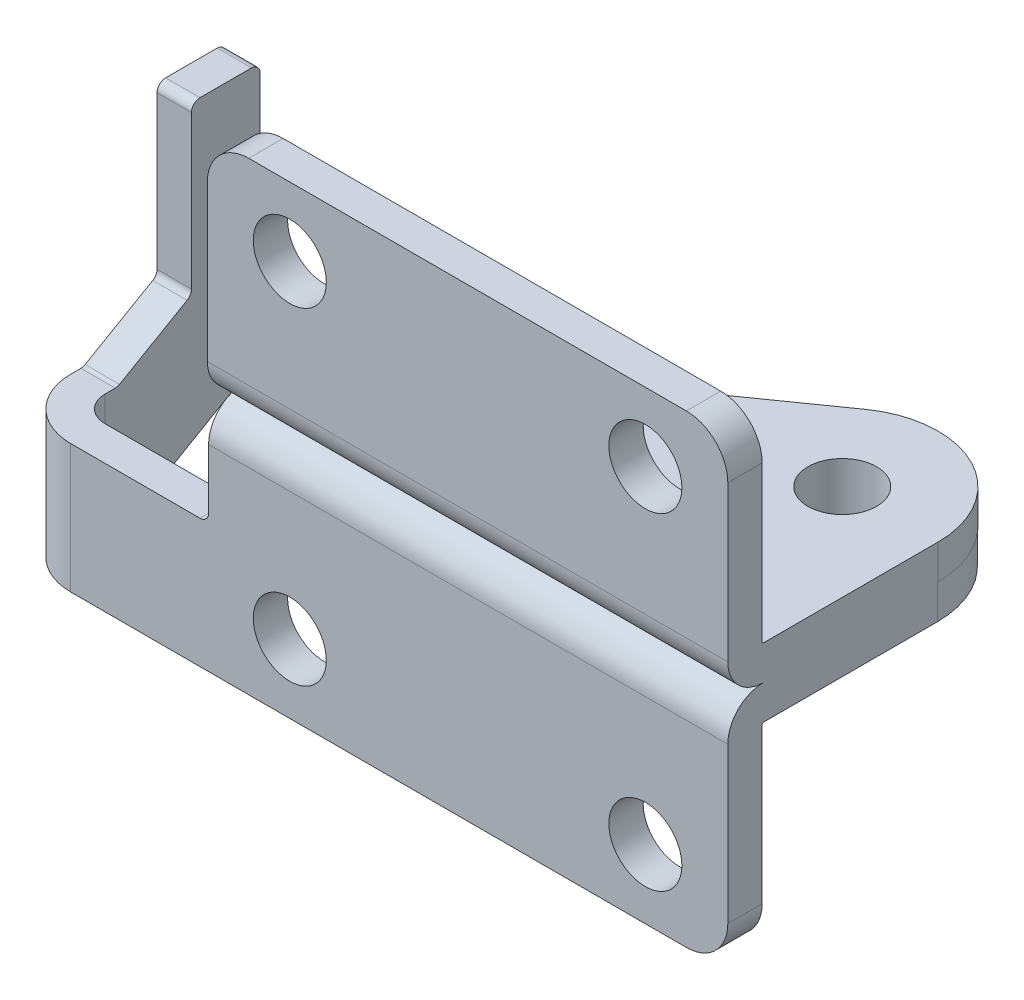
ISO-10303-21;
HEADER;
FILE_DESCRIPTION(('STEP AP214'),'2;1');
FILE_NAME('part.step','',(''),(''),'','','');
FILE_SCHEMA(('AUTOMOTIVE_DESIGN { 1 0 10303 214 1 1 1 1 }'));
ENDSEC;
DATA;
#1=APPLICATION_CONTEXT('core data for automotive mechanical design processes');
#2=APPLICATION_PROTOCOL_DEFINITION('international standard','automotive_design',2000,#1);
#3=PRODUCT_CONTEXT('',#1,'mechanical');
#4=PRODUCT('Part','Part','',(#3));
#5=PRODUCT_RELATED_PRODUCT_CATEGORY('part','',(#4));
#6=PRODUCT_DEFINITION_FORMATION('','',#4);
#7=PRODUCT_DEFINITION_CONTEXT('part definition',#1,'design');
#8=PRODUCT_DEFINITION('design','',#6,#7);
#9=PRODUCT_DEFINITION_SHAPE('','',#8);
#10=(LENGTH_UNIT() NAMED_UNIT(*) SI_UNIT(.MILLI.,.METRE.));
#11=(NAMED_UNIT(*) PLANE_ANGLE_UNIT() SI_UNIT($,.RADIAN.));
#12=(NAMED_UNIT(*) SI_UNIT($,.STERADIAN.) SOLID_ANGLE_UNIT());
#13=UNCERTAINTY_MEASURE_WITH_UNIT(LENGTH_MEASURE(1.E-05),#10,'distance_accuracy_value','');
#14=(GEOMETRIC_REPRESENTATION_CONTEXT(3) GLOBAL_UNCERTAINTY_ASSIGNED_CONTEXT((#13)) GLOBAL_UNIT_ASSIGNED_CONTEXT((#10,
#11,#12)) REPRESENTATION_CONTEXT('',''));
#15=CARTESIAN_POINT('',(0.,0.,0.));
#16=DIRECTION('',(0.,0.,1.));
#17=DIRECTION('',(1.,0.,0.));
#18=AXIS2_PLACEMENT_3D('',#15,#16,#17);
#19=CARTESIAN_POINT('',(-72.3259999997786,-35.1727296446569,-16.0518694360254));
#20=DIRECTION('',(1.,0.,0.));
#21=DIRECTION('',(0.,0.,-1.));
#22=AXIS2_PLACEMENT_3D('',#19,#20,#21);
#23=CYLINDRICAL_SURFACE('',#22,1.);
#24=DIRECTION('',(1.,0.,0.));
#25=VECTOR('',#24,1.);
#26=CARTESIAN_POINT('',(-72.3259999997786,-36.0387550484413,-16.5518694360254));
#27=LINE('',#26,#25);
#28=CARTESIAN_POINT('',(-68.3259999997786,-36.0387550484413,-16.5518694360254));
#29=VERTEX_POINT('',#28);
#30=CARTESIAN_POINT('',(-72.3259999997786,-36.0387550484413,-16.5518694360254));
#31=VERTEX_POINT('',#30);
#32=EDGE_CURVE('E1104',#29,#31,#27,.F.);
#33=ORIENTED_EDGE('',*,*,#32,.F.);
#34=CARTESIAN_POINT('',(-68.3259999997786,-35.1727296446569,-17.0518694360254));
#35=CARTESIAN_POINT('',(-68.3259999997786,-35.4412254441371,-17.0518694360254));
#36=CARTESIAN_POINT('',(-68.3259999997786,-35.6727296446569,-16.9178948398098));
#37=CARTESIAN_POINT('',(-68.3259999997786,-35.9050547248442,-16.783445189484));
#38=CARTESIAN_POINT('',(-68.3259999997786,-36.0387550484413,-16.5518694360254));
#39=B_SPLINE_CURVE_WITH_KNOTS('',2,(#34,#35,#36,#37,#38),.UNSPECIFIED.,.F.,.F.,(3,2,3),(0.,0.5,
1.),.UNSPECIFIED.);
#40=CARTESIAN_POINT('',(-68.3259999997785,-35.1727296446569,-17.0518694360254));
#41=VERTEX_POINT('',#40);
#42=EDGE_CURVE('E1557',#41,#29,#39,.T.);
#43=ORIENTED_EDGE('',*,*,#42,.F.);
#44=DIRECTION('',(1.,0.,0.));
#45=VECTOR('',#44,1.);
#46=CARTESIAN_POINT('',(-72.3259999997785,-35.1727296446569,-17.0518694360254));
#47=LINE('',#46,#45);
#48=CARTESIAN_POINT('',(-72.3259999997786,-35.1727296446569,-17.0518694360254));
#49=VERTEX_POINT('',#48);
#50=EDGE_CURVE('E1094',#49,#41,#47,.T.);
#51=ORIENTED_EDGE('',*,*,#50,.F.);
#52=CARTESIAN_POINT('',(-72.3259999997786,-36.0387550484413,-16.5518694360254));
#53=CARTESIAN_POINT('',(-72.3259999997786,-35.905054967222,-16.7834447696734));
#54=CARTESIAN_POINT('',(-72.3259999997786,-35.6727296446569,-16.9178948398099));
#55=CARTESIAN_POINT('',(-72.3259999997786,-35.4412259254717,-17.0518694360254));
#56=CARTESIAN_POINT('',(-72.3259999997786,-35.1727296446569,-17.0518694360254));
#57=B_SPLINE_CURVE_WITH_KNOTS('',2,(#52,#53,#54,#55,#56),.UNSPECIFIED.,.F.,.F.,(3,2,3),(0.,0.5,
1.),.UNSPECIFIED.);
#58=EDGE_CURVE('E2028',#31,#49,#57,.T.);
#59=ORIENTED_EDGE('',*,*,#58,.F.);
#60=EDGE_LOOP('',(#33,#43,#51,#59));
#61=FACE_BOUND('',#60,.T.);
#62=ADVANCED_FACE('F14',(#61),#23,.F.);
#63=CARTESIAN_POINT('',(-72.3259999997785,-17.3634795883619,-18.0518694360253));
#64=DIRECTION('',(1.,0.,0.));
#65=DIRECTION('',(0.,0.,-1.));
#66=AXIS2_PLACEMENT_3D('',#63,#64,#65);
#67=CYLINDRICAL_SURFACE('',#66,1.);
#68=CARTESIAN_POINT('',(-72.3259999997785,-17.3634795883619,-18.0518694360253));
#69=DIRECTION('',(1.,0.,0.));
#70=DIRECTION('',(0.,1.,0.));
#71=AXIS2_PLACEMENT_3D('',#68,#69,#70);
#72=CIRCLE('',#71,1.);
#73=CARTESIAN_POINT('',(-72.3259999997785,-16.3634795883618,-18.0518694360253));
#74=VERTEX_POINT('',#73);
#75=CARTESIAN_POINT('',(-72.3259999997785,-17.3634795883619,-17.0518694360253));
#76=VERTEX_POINT('',#75);
#77=EDGE_CURVE('E2227',#74,#76,#72,.T.);
#78=ORIENTED_EDGE('',*,*,#77,.T.);
#79=DIRECTION('',(1.,0.,0.));
#80=VECTOR('',#79,1.);
#81=CARTESIAN_POINT('',(-72.3259999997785,-17.3634795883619,-17.0518694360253));
#82=LINE('',#81,#80);
#83=CARTESIAN_POINT('',(-68.3259999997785,-17.3634795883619,-17.0518694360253));
#84=VERTEX_POINT('',#83);
#85=EDGE_CURVE('E1099',#84,#76,#82,.F.);
#86=ORIENTED_EDGE('',*,*,#85,.F.);
#87=CARTESIAN_POINT('',(-68.3259999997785,-17.3634795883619,-18.0518694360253));
#88=DIRECTION('',(-1.,0.,0.));
#89=DIRECTION('',(0.,0.,1.));
#90=AXIS2_PLACEMENT_3D('',#87,#88,#89);
#91=CIRCLE('',#90,1.);
#92=CARTESIAN_POINT('',(-68.3259999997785,-16.3634795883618,-18.0518694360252));
#93=VERTEX_POINT('',#92);
#94=EDGE_CURVE('E2270',#84,#93,#91,.T.);
#95=ORIENTED_EDGE('',*,*,#94,.T.);
#96=DIRECTION('',(1.,0.,0.));
#97=VECTOR('',#96,1.);
#98=CARTESIAN_POINT('',(-72.3259999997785,-16.3634795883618,-18.0518694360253));
#99=LINE('',#98,#97);
#100=EDGE_CURVE('E1084',#74,#93,#99,.T.);
#101=ORIENTED_EDGE('',*,*,#100,.F.);
#102=EDGE_LOOP('',(#78,#86,#95,#101));
#103=FACE_BOUND('',#102,.T.);
#104=ADVANCED_FACE('F1901',(#103),#67,.T.);
#105=CARTESIAN_POINT('',(-72.3259999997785,-17.3634795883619,-24.0518694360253));
#106=DIRECTION('',(1.,0.,0.));
#107=DIRECTION('',(0.,0.,-1.));
#108=AXIS2_PLACEMENT_3D('',#105,#106,#107);
#109=CYLINDRICAL_SURFACE('',#108,1.);
#110=CARTESIAN_POINT('',(-72.3259999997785,-17.3634795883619,-24.0518694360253));
#111=DIRECTION('',(1.,0.,0.));
#112=DIRECTION('',(0.,0.,-1.));
#113=AXIS2_PLACEMENT_3D('',#110,#111,#112);
#114=CIRCLE('',#113,1.);
#115=CARTESIAN_POINT('',(-72.3259999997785,-17.3634795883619,-25.0518694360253));
#116=VERTEX_POINT('',#115);
#117=CARTESIAN_POINT('',(-72.3259999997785,-16.3634795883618,-24.0518694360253));
#118=VERTEX_POINT('',#117);
#119=EDGE_CURVE('E1037',#116,#118,#114,.T.);
#120=ORIENTED_EDGE('',*,*,#119,.T.);
#121=DIRECTION('',(1.,0.,0.));
#122=VECTOR('',#121,1.);
#123=CARTESIAN_POINT('',(-72.3259999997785,-16.3634795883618,-24.0518694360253));
#124=LINE('',#123,#122);
#125=CARTESIAN_POINT('',(-68.3259999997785,-16.3634795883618,-24.0518694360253));
#126=VERTEX_POINT('',#125);
#127=EDGE_CURVE('E1089',#126,#118,#124,.F.);
#128=ORIENTED_EDGE('',*,*,#127,.F.);
#129=CARTESIAN_POINT('',(-68.3259999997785,-17.3634795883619,-24.0518694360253));
#130=DIRECTION('',(-1.,0.,0.));
#131=DIRECTION('',(0.,1.,0.));
#132=AXIS2_PLACEMENT_3D('',#129,#130,#131);
#133=CIRCLE('',#132,1.);
#134=CARTESIAN_POINT('',(-68.3259999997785,-17.3634795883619,-25.0518694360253));
#135=VERTEX_POINT('',#134);
#136=EDGE_CURVE('E2215',#126,#135,#133,.T.);
#137=ORIENTED_EDGE('',*,*,#136,.T.);
#138=DIRECTION('',(-1.,0.,0.));
#139=VECTOR('',#138,1.);
#140=CARTESIAN_POINT('',(-72.3259999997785,-17.3634795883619,-25.0518694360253));
#141=LINE('',#140,#139);
#142=EDGE_CURVE('E1077',#116,#135,#141,.F.);
#143=ORIENTED_EDGE('',*,*,#142,.F.);
#144=EDGE_LOOP('',(#120,#128,#137,#143));
#145=FACE_BOUND('',#144,.T.);
#146=ADVANCED_FACE('F1874',(#145),#109,.T.);
#147=CARTESIAN_POINT('',(-72.3259999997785,-45.3992269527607,-24.0518694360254));
#148=DIRECTION('',(1.,0.,0.));
#149=DIRECTION('',(0.,0.,-1.));
#150=AXIS2_PLACEMENT_3D('',#147,#148,#149);
#151=CYLINDRICAL_SURFACE('',#150,1.);
#152=CARTESIAN_POINT('',(-72.3259999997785,-45.3992269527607,-25.0518694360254));
#153=CARTESIAN_POINT('',(-72.3259999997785,-45.6666271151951,-25.0518694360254));
#154=CARTESIAN_POINT('',(-72.3259999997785,-45.8992269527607,-24.9178948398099));
#155=CARTESIAN_POINT('',(-72.3259999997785,-46.1310042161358,-24.7843940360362));
#156=CARTESIAN_POINT('',(-72.3259999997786,-46.2652523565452,-24.5518694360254));
#157=B_SPLINE_CURVE_WITH_KNOTS('',2,(#152,#153,#154,#155,#156),.UNSPECIFIED.,.F.,.F.,(3,2,3),
(0.,0.5,1.),.UNSPECIFIED.);
#158=CARTESIAN_POINT('',(-72.3259999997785,-45.3992269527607,-25.0518694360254));
#159=VERTEX_POINT('',#158);
#160=CARTESIAN_POINT('',(-72.3259999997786,-46.2652523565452,-24.5518694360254));
#161=VERTEX_POINT('',#160);
#162=EDGE_CURVE('E994',#159,#161,#157,.T.);
#163=ORIENTED_EDGE('',*,*,#162,.F.);
#164=DIRECTION('',(-1.,0.,0.));
#165=VECTOR('',#164,1.);
#166=CARTESIAN_POINT('',(-72.3259999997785,-45.3992269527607,-25.0518694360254));
#167=LINE('',#166,#165);
#168=CARTESIAN_POINT('',(-68.3259999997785,-45.3992269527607,-25.0518694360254));
#169=VERTEX_POINT('',#168);
#170=EDGE_CURVE('E1080',#169,#159,#167,.T.);
#171=ORIENTED_EDGE('',*,*,#170,.F.);
#172=CARTESIAN_POINT('',(-68.3259999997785,-45.3992269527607,-24.0518694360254));
#173=DIRECTION('',(-1.,0.,0.));
#174=DIRECTION('',(0.,0.,-1.));
#175=AXIS2_PLACEMENT_3D('',#172,#173,#174);
#176=CIRCLE('',#175,1.);
#177=CARTESIAN_POINT('',(-68.3259999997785,-46.2652523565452,-24.5518694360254));
#178=VERTEX_POINT('',#177);
#179=EDGE_CURVE('E952',#169,#178,#176,.T.);
#180=ORIENTED_EDGE('',*,*,#179,.T.);
#181=DIRECTION('',(1.,0.,0.));
#182=VECTOR('',#181,1.);
#183=CARTESIAN_POINT('',(-72.3259999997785,-46.2652523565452,-24.5518694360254));
#184=LINE('',#183,#182);
#185=EDGE_CURVE('E489',#161,#178,#184,.T.);
#186=ORIENTED_EDGE('',*,*,#185,.F.);
#187=EDGE_LOOP('',(#163,#171,#180,#186));
#188=FACE_BOUND('',#187,.T.);
#189=ADVANCED_FACE('F1868',(#188),#151,.T.);
#190=CARTESIAN_POINT('',(41.7016982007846,-24.488,-4.15));
#191=DIRECTION('',(-1.,0.,0.));
#192=DIRECTION('',(0.,-1.,0.));
#193=AXIS2_PLACEMENT_3D('',#190,#191,#192);
#194=CYLINDRICAL_SURFACE('',#193,0.15);
#195=CARTESIAN_POINT('',(-49.4239999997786,-24.4879999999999,-4.15));
#196=DIRECTION('',(-1.,0.,0.));
#197=DIRECTION('',(0.,-1.,0.));
#198=AXIS2_PLACEMENT_3D('',#195,#196,#197);
#199=CIRCLE('',#198,0.150000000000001);
#200=CARTESIAN_POINT('',(-49.4239999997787,-24.638,-4.15));
#201=VERTEX_POINT('',#200);
#202=CARTESIAN_POINT('',(-49.4239999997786,-24.488,-4.));
#203=VERTEX_POINT('',#202);
#204=EDGE_CURVE('E2067',#201,#203,#199,.T.);
#205=ORIENTED_EDGE('',*,*,#204,.T.);
#206=DIRECTION('',(1.,0.,0.));
#207=VECTOR('',#206,1.);
#208=CARTESIAN_POINT('',(-44.5979999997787,-24.488,-4.));
#209=LINE('',#208,#207);
#210=CARTESIAN_POINT('',(11.1760000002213,-24.488,-4.));
#211=VERTEX_POINT('',#210);
#212=EDGE_CURVE('E472',#203,#211,#209,.T.);
#213=ORIENTED_EDGE('',*,*,#212,.T.);
#214=CARTESIAN_POINT('',(11.1760000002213,-24.638,-4.15));
#215=CARTESIAN_POINT('',(11.1760000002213,-24.638,-4.08711057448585));
#216=CARTESIAN_POINT('',(11.1760000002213,-24.594066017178,-4.04393398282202));
#217=CARTESIAN_POINT('',(11.1760000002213,-24.5493613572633,-4.));
#218=CARTESIAN_POINT('',(11.1760000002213,-24.488,-4.));
#219=B_SPLINE_CURVE_WITH_KNOTS('',2,(#214,#215,#216,#217,#218),.UNSPECIFIED.,.F.,.F.,(3,2,3),
(0.,0.5,1.),.UNSPECIFIED.);
#220=CARTESIAN_POINT('',(11.1760000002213,-24.638,-4.15));
#221=VERTEX_POINT('',#220);
#222=EDGE_CURVE('E2132',#221,#211,#219,.T.);
#223=ORIENTED_EDGE('',*,*,#222,.F.);
#224=DIRECTION('',(1.,0.,0.));
#225=VECTOR('',#224,1.);
#226=CARTESIAN_POINT('',(-44.5979999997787,-24.638,-4.15));
#227=LINE('',#226,#225);
#228=EDGE_CURVE('E388',#221,#201,#227,.F.);
#229=ORIENTED_EDGE('',*,*,#228,.T.);
#230=EDGE_LOOP('',(#205,#213,#223,#229));
#231=FACE_BOUND('',#230,.T.);
#232=ADVANCED_FACE('F1873',(#231),#194,.F.);
#233=CARTESIAN_POINT('',(-44.5979999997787,-6.414,0.));
#234=DIRECTION('',(0.,0.,1.));
#235=DIRECTION('',(0.,-1.,0.));
#236=AXIS2_PLACEMENT_3D('',#233,#234,#235);
#237=CYLINDRICAL_SURFACE('',#236,4.826);
#238=CARTESIAN_POINT('',(-44.5979999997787,-1.588,0.));
#239=CARTESIAN_POINT('',(-45.5182608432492,-1.588,0.));
#240=CARTESIAN_POINT('',(-46.3744250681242,-1.92684165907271,0.));
#241=CARTESIAN_POINT('',(-46.8288608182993,-2.10669239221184,0.));
#242=CARTESIAN_POINT('',(-47.2388342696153,-2.37465966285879,0.));
#243=CARTESIAN_POINT('',(-47.6567034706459,-2.64778776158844,0.));
#244=CARTESIAN_POINT('',(-48.0104973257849,-3.00150267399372,0.));
#245=CARTESIAN_POINT('',(-48.3635336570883,-3.35446023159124,0.));
#246=CARTESIAN_POINT('',(-48.6373403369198,-3.77316573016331,0.));
#247=CARTESIAN_POINT('',(-48.9048240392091,-4.18220212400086,0.));
#248=CARTESIAN_POINT('',(-49.0851583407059,-4.6375749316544,0.));
#249=CARTESIAN_POINT('',(-49.4239999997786,-5.49320404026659,0.));
#250=CARTESIAN_POINT('',(-49.4239999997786,-6.414,0.));
#251=B_SPLINE_CURVE_WITH_KNOTS('',2,(#238,#239,#240,#241,#242,#243,#244,#245,#246,#247,#248,
#249,#250),.UNSPECIFIED.,.F.,.F.,(3,2,2,2,2,2,3),(0.,0.25,0.375,0.5,0.625,0.75,1.),.UNSPECIFIED.);
#252=CARTESIAN_POINT('',(-44.5979999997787,-1.588,0.));
#253=VERTEX_POINT('',#252);
#254=CARTESIAN_POINT('',(-49.4239999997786,-6.414,0.));
#255=VERTEX_POINT('',#254);
#256=EDGE_CURVE('E798',#253,#255,#251,.T.);
#257=ORIENTED_EDGE('',*,*,#256,.F.);
#258=DIRECTION('',(0.,0.,1.));
#259=VECTOR('',#258,1.);
#260=CARTESIAN_POINT('',(-44.5979999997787,-1.58799999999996,60.7942492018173));
#261=LINE('',#260,#259);
#262=CARTESIAN_POINT('',(-44.5979999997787,-1.588,-4.));
#263=VERTEX_POINT('',#262);
#264=EDGE_CURVE('E2130',#263,#253,#261,.T.);
#265=ORIENTED_EDGE('',*,*,#264,.F.);
#266=CARTESIAN_POINT('',(-44.5979999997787,-6.414,-4.));
#267=DIRECTION('',(0.,0.,1.));
#268=DIRECTION('',(0.,1.,0.));
#269=AXIS2_PLACEMENT_3D('',#266,#267,#268);
#270=CIRCLE('',#269,4.826);
#271=CARTESIAN_POINT('',(-49.4239999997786,-6.414,-4.));
#272=VERTEX_POINT('',#271);
#273=EDGE_CURVE('E464',#263,#272,#270,.T.);
#274=ORIENTED_EDGE('',*,*,#273,.T.);
#275=DIRECTION('',(0.,0.,1.));
#276=VECTOR('',#275,1.);
#277=CARTESIAN_POINT('',(-49.4239999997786,-6.414,0.));
#278=LINE('',#277,#276);
#279=EDGE_CURVE('E2307',#272,#255,#278,.T.);
#280=ORIENTED_EDGE('',*,*,#279,.T.);
#281=EDGE_LOOP('',(#257,#265,#274,#280));
#282=FACE_BOUND('',#281,.T.);
#283=ADVANCED_FACE('F1880',(#282),#237,.T.);
#284=CARTESIAN_POINT('',(-39.8239999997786,-9.588,0.));
#285=DIRECTION('',(0.,0.,-1.));
#286=DIRECTION('',(0.,1.,0.));
#287=AXIS2_PLACEMENT_3D('',#284,#285,#286);
#288=CYLINDRICAL_SURFACE('',#287,4.25);
#289=CARTESIAN_POINT('',(-39.8239999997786,-9.588,-3.99999999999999));
#290=DIRECTION('',(0.,0.,-1.));
#291=DIRECTION('',(0.,-1.,0.));
#292=AXIS2_PLACEMENT_3D('',#289,#290,#291);
#293=CIRCLE('',#292,4.25);
#294=CARTESIAN_POINT('',(-39.8239999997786,-13.838,-4.));
#295=VERTEX_POINT('',#294);
#296=CARTESIAN_POINT('',(-39.8239999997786,-5.338,-4.));
#297=VERTEX_POINT('',#296);
#298=EDGE_CURVE('E461',#295,#297,#293,.T.);
#299=ORIENTED_EDGE('',*,*,#298,.T.);
#300=CARTESIAN_POINT('',(-39.8239999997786,-9.588,-3.99999999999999));
#301=DIRECTION('',(0.,0.,-1.));
#302=DIRECTION('',(0.,1.,0.));
#303=AXIS2_PLACEMENT_3D('',#300,#301,#302);
#304=CIRCLE('',#303,4.25);
#305=EDGE_CURVE('E460',#297,#295,#304,.T.);
#306=ORIENTED_EDGE('',*,*,#305,.T.);
#307=EDGE_LOOP('',(#299,#306));
#308=FACE_BOUND('',#307,.T.);
#309=CARTESIAN_POINT('',(-39.8239999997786,-13.838,0.));
#310=CARTESIAN_POINT('',(-40.6343925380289,-13.838,0.));
#311=CARTESIAN_POINT('',(-41.3884025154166,-13.5396002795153,0.));
#312=CARTESIAN_POINT('',(-41.7885438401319,-13.3812442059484,0.));
#313=CARTESIAN_POINT('',(-42.1496414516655,-13.1452309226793,0.));
#314=CARTESIAN_POINT('',(-42.5175865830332,-12.9047421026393,0.));
#315=CARTESIAN_POINT('',(-42.8292038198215,-12.5932038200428,0.));
#316=CARTESIAN_POINT('',(-43.1400635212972,-12.2824228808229,0.));
#317=CARTESIAN_POINT('',(-43.3812309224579,-11.9136414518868,0.));
#318=CARTESIAN_POINT('',(-43.6167606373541,-11.5534808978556,0.));
#319=CARTESIAN_POINT('',(-43.775600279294,-11.152402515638,0.));
#320=CARTESIAN_POINT('',(-44.0738987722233,-10.399183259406,0.));
#321=CARTESIAN_POINT('',(-44.0739999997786,-9.588,0.));
#322=CARTESIAN_POINT('',(-44.0741010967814,-8.77786291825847,0.));
#323=CARTESIAN_POINT('',(-43.775600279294,-8.02359748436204,0.));
#324=CARTESIAN_POINT('',(-43.6172442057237,-7.62345615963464,0.));
#325=CARTESIAN_POINT('',(-43.3812309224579,-7.26235854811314,0.));
#326=CARTESIAN_POINT('',(-43.1407421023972,-6.89441341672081,0.));
#327=CARTESIAN_POINT('',(-42.8292038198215,-6.58279617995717,0.));
#328=CARTESIAN_POINT('',(-42.5184228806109,-6.27193647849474,0.));
#329=CARTESIAN_POINT('',(-42.1496414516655,-6.03076907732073,0.));
#330=CARTESIAN_POINT('',(-41.7894808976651,-5.79523936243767,0.));
#331=CARTESIAN_POINT('',(-41.3884025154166,-5.63639972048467,0.));
#332=CARTESIAN_POINT('',(-40.6349276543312,-5.338,0.));
#333=CARTESIAN_POINT('',(-39.8239999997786,-5.338,0.));
#334=B_SPLINE_CURVE_WITH_KNOTS('',2,(#309,#310,#311,#312,#313,#314,#315,#316,#317,#318,#319,
#320,#321,#322,#323,#324,#325,#326,#327,#328,#329,#330,#331,#332,#333),.UNSPECIFIED.,.F.,.F.,(3,
2,2,2,2,2,2,2,2,2,2,2,3),(0.,0.125,0.1875,0.25,0.3125,0.375,0.5,0.625,0.6875,0.75,0.8125,0.875,
1.),.UNSPECIFIED.);
#335=CARTESIAN_POINT('',(-39.8239999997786,-13.838,0.));
#336=VERTEX_POINT('',#335);
#337=CARTESIAN_POINT('',(-39.8239999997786,-5.338,0.));
#338=VERTEX_POINT('',#337);
#339=EDGE_CURVE('E786',#336,#338,#334,.T.);
#340=ORIENTED_EDGE('',*,*,#339,.F.);
#341=CARTESIAN_POINT('',(-39.8239999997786,-5.338,0.));
#342=CARTESIAN_POINT('',(-39.0136074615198,-5.338,0.));
#343=CARTESIAN_POINT('',(-38.2595974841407,-5.63639972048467,0.));
#344=CARTESIAN_POINT('',(-37.8594561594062,-5.79475579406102,0.));
#345=CARTESIAN_POINT('',(-37.4983585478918,-6.03076907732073,0.));
#346=CARTESIAN_POINT('',(-37.1304134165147,-6.27125789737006,0.));
#347=CARTESIAN_POINT('',(-36.8187961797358,-6.58279617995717,0.));
#348=CARTESIAN_POINT('',(-36.5079364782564,-6.89357711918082,0.));
#349=CARTESIAN_POINT('',(-36.2667690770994,-7.26235854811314,0.));
#350=CARTESIAN_POINT('',(-36.031239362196,-7.62251910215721,0.));
#351=CARTESIAN_POINT('',(-35.8723997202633,-8.02359748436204,0.));
#352=CARTESIAN_POINT('',(-35.574101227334,-8.77681674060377,0.));
#353=CARTESIAN_POINT('',(-35.5739999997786,-9.588,0.));
#354=CARTESIAN_POINT('',(-35.5738989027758,-10.3981370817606,0.));
#355=CARTESIAN_POINT('',(-35.8723997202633,-11.152402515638,0.));
#356=CARTESIAN_POINT('',(-36.0307557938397,-11.5525438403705,0.));
#357=CARTESIAN_POINT('',(-36.2667690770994,-11.9136414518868,0.));
#358=CARTESIAN_POINT('',(-36.5072578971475,-12.2815865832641,0.));
#359=CARTESIAN_POINT('',(-36.8187961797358,-12.5932038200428,0.));
#360=CARTESIAN_POINT('',(-37.1295771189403,-12.9040635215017,0.));
#361=CARTESIAN_POINT('',(-37.4983585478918,-13.1452309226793,0.));
#362=CARTESIAN_POINT('',(-37.8585191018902,-13.3807606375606,0.));
#363=CARTESIAN_POINT('',(-38.2595974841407,-13.5396002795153,0.));
#364=CARTESIAN_POINT('',(-39.0130723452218,-13.838,0.));
#365=CARTESIAN_POINT('',(-39.8239999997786,-13.838,0.));
#366=B_SPLINE_CURVE_WITH_KNOTS('',2,(#341,#342,#343,#344,#345,#346,#347,#348,#349,#350,#351,
#352,#353,#354,#355,#356,#357,#358,#359,#360,#361,#362,#363,#364,#365),.UNSPECIFIED.,.F.,.F.,(3,
2,2,2,2,2,2,2,2,2,2,2,3),(0.,0.125,0.1875,0.25,0.3125,0.375,0.5,0.625,0.6875,0.75,0.8125,0.875,
1.),.UNSPECIFIED.);
#367=EDGE_CURVE('E450',#338,#336,#366,.T.);
#368=ORIENTED_EDGE('',*,*,#367,.F.);
#369=EDGE_LOOP('',(#340,#368));
#370=FACE_BOUND('',#369,.T.);
#371=ADVANCED_FACE('F412',(#308,#370),#288,.F.);
#372=CARTESIAN_POINT('',(1.57600000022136,-9.588,0.));
#373=DIRECTION('',(0.,0.,-1.));
#374=DIRECTION('',(0.,1.,0.));
#375=AXIS2_PLACEMENT_3D('',#372,#373,#374);
#376=CYLINDRICAL_SURFACE('',#375,4.25);
#377=CARTESIAN_POINT('',(1.57600000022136,-9.588,-3.99999999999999));
#378=DIRECTION('',(0.,0.,-1.));
#379=DIRECTION('',(0.,-1.,0.));
#380=AXIS2_PLACEMENT_3D('',#377,#378,#379);
#381=CIRCLE('',#380,4.25);
#382=CARTESIAN_POINT('',(1.57600000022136,-13.838,-4.));
#383=VERTEX_POINT('',#382);
#384=CARTESIAN_POINT('',(1.57600000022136,-5.338,-4.));
#385=VERTEX_POINT('',#384);
#386=EDGE_CURVE('E395',#383,#385,#381,.T.);
#387=ORIENTED_EDGE('',*,*,#386,.T.);
#388=CARTESIAN_POINT('',(1.57600000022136,-9.588,-3.99999999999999));
#389=DIRECTION('',(0.,0.,-1.));
#390=DIRECTION('',(0.,1.,0.));
#391=AXIS2_PLACEMENT_3D('',#388,#389,#390);
#392=CIRCLE('',#391,4.25);
#393=EDGE_CURVE('E437',#385,#383,#392,.T.);
#394=ORIENTED_EDGE('',*,*,#393,.T.);
#395=EDGE_LOOP('',(#387,#394));
#396=FACE_BOUND('',#395,.T.);
#397=CARTESIAN_POINT('',(1.57600000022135,-13.838,0.));
#398=CARTESIAN_POINT('',(0.76560746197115,-13.838,0.));
#399=CARTESIAN_POINT('',(0.0115974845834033,-13.5396002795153,0.));
#400=CARTESIAN_POINT('',(-0.388543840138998,-13.3812442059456,0.));
#401=CARTESIAN_POINT('',(-0.749641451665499,-13.1452309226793,0.));
#402=CARTESIAN_POINT('',(-1.1175865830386,-12.9047421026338,0.));
#403=CARTESIAN_POINT('',(-1.42920381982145,-12.5932038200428,0.));
#404=CARTESIAN_POINT('',(-1.7400635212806,-12.2824228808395,0.));
#405=CARTESIAN_POINT('',(-1.9812309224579,-11.9136414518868,0.));
#406=CARTESIAN_POINT('',(-2.21676063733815,-11.5534808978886,0.));
#407=CARTESIAN_POINT('',(-2.37560027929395,-11.152402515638,0.));
#408=CARTESIAN_POINT('',(-2.673898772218,-10.3991832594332,0.));
#409=CARTESIAN_POINT('',(-2.67399999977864,-9.588,0.));
#410=CARTESIAN_POINT('',(-2.67410109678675,-8.77786291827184,0.));
#411=CARTESIAN_POINT('',(-2.37560027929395,-8.02359748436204,0.));
#412=CARTESIAN_POINT('',(-2.21724420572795,-7.62345615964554,0.));
#413=CARTESIAN_POINT('',(-1.9812309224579,-7.26235854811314,0.));
#414=CARTESIAN_POINT('',(-1.74074210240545,-6.89441341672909,0.));
#415=CARTESIAN_POINT('',(-1.42920381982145,-6.58279617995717,0.));
#416=CARTESIAN_POINT('',(-1.11842288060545,-6.27193647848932,0.));
#417=CARTESIAN_POINT('',(-0.749641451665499,-6.03076907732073,0.));
#418=CARTESIAN_POINT('',(-0.389480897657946,-5.79523936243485,0.));
#419=CARTESIAN_POINT('',(0.0115974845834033,-5.63639972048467,0.));
#420=CARTESIAN_POINT('',(0.765072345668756,-5.338,0.));
#421=CARTESIAN_POINT('',(1.57600000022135,-5.338,0.));
#422=B_SPLINE_CURVE_WITH_KNOTS('',2,(#397,#398,#399,#400,#401,#402,#403,#404,#405,#406,#407,
#408,#409,#410,#411,#412,#413,#414,#415,#416,#417,#418,#419,#420,#421),.UNSPECIFIED.,.F.,.F.,(3,
2,2,2,2,2,2,2,2,2,2,2,3),(0.,0.125,0.1875,0.25,0.3125,0.375,0.5,0.625,0.6875,0.75,0.8125,0.875,
1.),.UNSPECIFIED.);
#423=CARTESIAN_POINT('',(1.57600000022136,-13.838,0.));
#424=VERTEX_POINT('',#423);
#425=CARTESIAN_POINT('',(1.57600000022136,-5.338,0.));
#426=VERTEX_POINT('',#425);
#427=EDGE_CURVE('E743',#424,#426,#422,.T.);
#428=ORIENTED_EDGE('',*,*,#427,.F.);
#429=CARTESIAN_POINT('',(1.57600000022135,-5.338,0.));
#430=CARTESIAN_POINT('',(2.38639253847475,-5.338,0.));
#431=CARTESIAN_POINT('',(3.14040251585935,-5.63639972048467,0.));
#432=CARTESIAN_POINT('',(3.54054384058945,-5.79475579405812,0.));
#433=CARTESIAN_POINT('',(3.90164145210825,-6.03076907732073,0.));
#434=CARTESIAN_POINT('',(4.26958658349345,-6.27125789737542,0.));
#435=CARTESIAN_POINT('',(4.58120382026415,-6.58279617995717,0.));
#436=CARTESIAN_POINT('',(4.89206352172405,-6.89357711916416,0.));
#437=CARTESIAN_POINT('',(5.13323092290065,-7.26235854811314,0.));
#438=CARTESIAN_POINT('',(5.36876063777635,-7.62251910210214,0.));
#439=CARTESIAN_POINT('',(5.52760027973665,-8.02359748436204,0.));
#440=CARTESIAN_POINT('',(5.82589877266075,-8.77681674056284,0.));
#441=CARTESIAN_POINT('',(5.82600000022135,-9.588,0.));
#442=CARTESIAN_POINT('',(5.82610109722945,-10.3981370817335,0.));
#443=CARTESIAN_POINT('',(5.52760027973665,-11.152402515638,0.));
#444=CARTESIAN_POINT('',(5.36924420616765,-11.5525438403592,0.));
#445=CARTESIAN_POINT('',(5.13323092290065,-11.9136414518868,0.));
#446=CARTESIAN_POINT('',(4.89274210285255,-12.2815865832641,0.));
#447=CARTESIAN_POINT('',(4.58120382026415,-12.5932038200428,0.));
#448=CARTESIAN_POINT('',(4.27042288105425,-12.9040635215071,0.));
#449=CARTESIAN_POINT('',(3.90164145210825,-13.1452309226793,0.));
#450=CARTESIAN_POINT('',(3.54148089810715,-13.3807606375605,0.));
#451=CARTESIAN_POINT('',(3.14040251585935,-13.5396002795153,0.));
#452=CARTESIAN_POINT('',(2.38692765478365,-13.838,0.));
#453=CARTESIAN_POINT('',(1.57600000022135,-13.838,0.));
#454=B_SPLINE_CURVE_WITH_KNOTS('',2,(#429,#430,#431,#432,#433,#434,#435,#436,#437,#438,#439,
#440,#441,#442,#443,#444,#445,#446,#447,#448,#449,#450,#451,#452,#453),.UNSPECIFIED.,.F.,.F.,(3,
2,2,2,2,2,2,2,2,2,2,2,3),(0.,0.125,0.1875,0.25,0.3125,0.375,0.5,0.625,0.6875,0.75,0.8125,0.875,
1.),.UNSPECIFIED.);
#455=EDGE_CURVE('E783',#426,#424,#454,.T.);
#456=ORIENTED_EDGE('',*,*,#455,.F.);
#457=EDGE_LOOP('',(#428,#456));
#458=FACE_BOUND('',#457,.T.);
#459=ADVANCED_FACE('F402',(#396,#458),#376,.F.);
#460=CARTESIAN_POINT('',(0.,-1.588,60.7942492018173));
#461=DIRECTION('',(0.,1.,0.));
#462=DIRECTION('',(-1.,0.,0.));
#463=AXIS2_PLACEMENT_3D('',#460,#461,#462);
#464=PLANE('',#463);
#465=DIRECTION('',(1.,0.,0.));
#466=VECTOR('',#465,1.);
#467=CARTESIAN_POINT('',(-44.5979999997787,-1.588,-4.));
#468=LINE('',#467,#466);
#469=CARTESIAN_POINT('',(6.35000000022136,-1.588,-4.));
#470=VERTEX_POINT('',#469);
#471=EDGE_CURVE('E466',#470,#263,#468,.F.);
#472=ORIENTED_EDGE('',*,*,#471,.T.);
#473=ORIENTED_EDGE('',*,*,#264,.T.);
#474=DIRECTION('',(1.,0.,0.));
#475=VECTOR('',#474,1.);
#476=CARTESIAN_POINT('',(-44.5979999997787,-1.588,0.));
#477=LINE('',#476,#475);
#478=CARTESIAN_POINT('',(6.35000000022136,-1.588,0.));
#479=VERTEX_POINT('',#478);
#480=EDGE_CURVE('E747',#479,#253,#477,.F.);
#481=ORIENTED_EDGE('',*,*,#480,.F.);
#482=DIRECTION('',(0.,0.,1.));
#483=VECTOR('',#482,1.);
#484=CARTESIAN_POINT('',(6.35000000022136,-1.588,60.7942492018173));
#485=LINE('',#484,#483);
#486=EDGE_CURVE('E739',#470,#479,#485,.T.);
#487=ORIENTED_EDGE('',*,*,#486,.F.);
#488=EDGE_LOOP('',(#472,#473,#481,#487));
#489=FACE_BOUND('',#488,.T.);
#490=ADVANCED_FACE('F411',(#489),#464,.T.);
#491=CARTESIAN_POINT('',(-4.83911070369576E-09,-24.638,-24.5019999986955));
#492=DIRECTION('',(0.,1.,0.));
#493=DIRECTION('',(-1.,0.,0.));
#494=AXIS2_PLACEMENT_3D('',#491,#492,#493);
#495=CYLINDRICAL_SURFACE('',#494,4.);
#496=CARTESIAN_POINT('',(-4.83911070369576E-09,-24.638,-24.5019999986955));
#497=DIRECTION('',(0.,1.,0.));
#498=DIRECTION('',(1.,0.,-6.5222133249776E-11));
#499=AXIS2_PLACEMENT_3D('',#496,#497,#498);
#500=CIRCLE('',#499,4.);
#501=CARTESIAN_POINT('',(3.99999999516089,-24.638,-24.5019999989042));
#502=VERTEX_POINT('',#501);
#503=CARTESIAN_POINT('',(-4.00000000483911,-24.638,-24.5019999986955));
#504=VERTEX_POINT('',#503);
#505=EDGE_CURVE('E655',#502,#504,#500,.T.);
#506=ORIENTED_EDGE('',*,*,#505,.T.);
#507=CARTESIAN_POINT('',(-4.83911070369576E-09,-24.638,-24.5019999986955));
#508=DIRECTION('',(0.,1.,0.));
#509=DIRECTION('',(-1.,0.,0.));
#510=AXIS2_PLACEMENT_3D('',#507,#508,#509);
#511=CIRCLE('',#510,4.);
#512=EDGE_CURVE('E646',#504,#502,#511,.T.);
#513=ORIENTED_EDGE('',*,*,#512,.T.);
#514=EDGE_LOOP('',(#506,#513));
#515=FACE_BOUND('',#514,.T.);
#516=CARTESIAN_POINT('',(-4.83911666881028E-09,-32.638,-24.5019999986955));
#517=DIRECTION('',(0.,-1.,0.));
#518=DIRECTION('',(-1.,0.,0.));
#519=AXIS2_PLACEMENT_3D('',#516,#517,#518);
#520=CIRCLE('',#519,4.);
#521=CARTESIAN_POINT('',(-4.00000000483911,-32.638,-24.5019999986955));
#522=VERTEX_POINT('',#521);
#523=CARTESIAN_POINT('',(3.99999999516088,-32.638,-24.5019999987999));
#524=VERTEX_POINT('',#523);
#525=EDGE_CURVE('E1241',#522,#524,#520,.T.);
#526=ORIENTED_EDGE('',*,*,#525,.T.);
#527=CARTESIAN_POINT('',(-4.83911666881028E-09,-32.638,-24.5019999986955));
#528=DIRECTION('',(0.,-1.,0.));
#529=DIRECTION('',(1.,0.,0.));
#530=AXIS2_PLACEMENT_3D('',#527,#528,#529);
#531=CIRCLE('',#530,4.);
#532=EDGE_CURVE('E1293',#524,#522,#531,.T.);
#533=ORIENTED_EDGE('',*,*,#532,.T.);
#534=EDGE_LOOP('',(#526,#533));
#535=FACE_BOUND('',#534,.T.);
#536=ADVANCED_FACE('F615',(#515,#535),#495,.F.);
#537=CARTESIAN_POINT('',(-30.4924887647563,-28.638,-16.6114049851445));
#538=DIRECTION('',(-0.57635955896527,0.,-0.817196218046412));
#539=DIRECTION('',(-0.817196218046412,0.,0.57635955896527));
#540=AXIS2_PLACEMENT_3D('',#537,#538,#539);
#541=PLANE('',#540);
#542=DIRECTION('',(-0.817196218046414,0.,0.576359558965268));
#543=VECTOR('',#542,1.);
#544=CARTESIAN_POINT('',(-6.44139443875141,-28.638,-33.5743788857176));
#545=LINE('',#544,#543);
#546=CARTESIAN_POINT('',(-6.44139443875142,-28.638,-33.5743788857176));
#547=VERTEX_POINT('',#546);
#548=CARTESIAN_POINT('',(-30.4924887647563,-28.638,-16.6114049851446));
#549=VERTEX_POINT('',#548);
#550=EDGE_CURVE('E1225',#547,#549,#545,.T.);
#551=ORIENTED_EDGE('',*,*,#550,.F.);
#552=DIRECTION('',(0.,1.,0.));
#553=VECTOR('',#552,1.);
#554=CARTESIAN_POINT('',(-6.44139443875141,-28.638,-33.5743788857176));
#555=LINE('',#554,#553);
#556=CARTESIAN_POINT('',(-6.44139443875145,-32.638,-33.5743788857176));
#557=VERTEX_POINT('',#556);
#558=EDGE_CURVE('E2129',#547,#557,#555,.F.);
#559=ORIENTED_EDGE('',*,*,#558,.T.);
#560=DIRECTION('',(-0.817196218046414,0.,0.576359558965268));
#561=VECTOR('',#560,1.);
#562=CARTESIAN_POINT('',(-6.44139443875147,-32.638,-33.5743788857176));
#563=LINE('',#562,#561);
#564=CARTESIAN_POINT('',(-30.4924887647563,-32.638,-16.6114049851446));
#565=VERTEX_POINT('',#564);
#566=EDGE_CURVE('E1317',#557,#565,#563,.T.);
#567=ORIENTED_EDGE('',*,*,#566,.T.);
#568=DIRECTION('',(0.,-1.,0.));
#569=VECTOR('',#568,1.);
#570=CARTESIAN_POINT('',(-30.4924887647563,-28.638,-16.6114049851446));
#571=LINE('',#570,#569);
#572=EDGE_CURVE('E2068',#565,#549,#571,.F.);
#573=ORIENTED_EDGE('',*,*,#572,.T.);
#574=EDGE_LOOP('',(#551,#559,#567,#573));
#575=FACE_BOUND('',#574,.T.);
#576=ADVANCED_FACE('F624',(#575),#541,.T.);
#577=CARTESIAN_POINT('',(-33.274,-28.638,-20.5551939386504));
#578=DIRECTION('',(0.,-1.,0.));
#579=DIRECTION('',(0.,0.,-1.));
#580=AXIS2_PLACEMENT_3D('',#577,#578,#579);
#581=CYLINDRICAL_SURFACE('',#580,4.82600000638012);
#582=ORIENTED_EDGE('',*,*,#572,.F.);
#583=CARTESIAN_POINT('',(-33.274,-32.638,-20.5551939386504));
#584=DIRECTION('',(0.,-1.,0.));
#585=DIRECTION('',(0.576359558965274,0.,0.817196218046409));
#586=AXIS2_PLACEMENT_3D('',#583,#584,#585);
#587=CIRCLE('',#586,4.82600000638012);
#588=CARTESIAN_POINT('',(-33.274,-32.638,-15.7291939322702));
#589=VERTEX_POINT('',#588);
#590=EDGE_CURVE('E1271',#565,#589,#587,.T.);
#591=ORIENTED_EDGE('',*,*,#590,.T.);
#592=DIRECTION('',(0.,1.,0.));
#593=VECTOR('',#592,1.);
#594=CARTESIAN_POINT('',(-33.274,-28.638,-15.7291939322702));
#595=LINE('',#594,#593);
#596=CARTESIAN_POINT('',(-33.274,-28.638,-15.7291939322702));
#597=VERTEX_POINT('',#596);
#598=EDGE_CURVE('E574',#597,#589,#595,.F.);
#599=ORIENTED_EDGE('',*,*,#598,.F.);
#600=CARTESIAN_POINT('',(-30.4924887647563,-28.638,-16.6114049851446));
#601=CARTESIAN_POINT('',(-31.1024801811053,-28.638,-16.181184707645));
#602=CARTESIAN_POINT('',(-31.8149676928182,-28.638,-15.9550308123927));
#603=CARTESIAN_POINT('',(-32.5264564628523,-28.638,-15.7291939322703));
#604=CARTESIAN_POINT('',(-33.274,-28.638,-15.7291939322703));
#605=B_SPLINE_CURVE_WITH_KNOTS('',2,(#600,#601,#602,#603,#604),.UNSPECIFIED.,.F.,.F.,(3,2,3),
(0.,0.5,1.),.UNSPECIFIED.);
#606=EDGE_CURVE('E1222',#549,#597,#605,.T.);
#607=ORIENTED_EDGE('',*,*,#606,.F.);
#608=EDGE_LOOP('',(#582,#591,#599,#607));
#609=FACE_BOUND('',#608,.T.);
#610=ADVANCED_FACE('F1793',(#609),#581,.F.);
#611=CARTESIAN_POINT('',(-49.4239999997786,-6.44400000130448,0.));
#612=DIRECTION('',(1.,0.,0.));
#613=DIRECTION('',(0.,1.,0.));
#614=AXIS2_PLACEMENT_3D('',#611,#612,#613);
#615=PLANE('',#614);
#616=DIRECTION('',(0.,-1.,0.));
#617=VECTOR('',#616,1.);
#618=CARTESIAN_POINT('',(-49.4239999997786,-6.44400000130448,-4.));
#619=LINE('',#618,#617);
#620=EDGE_CURVE('E477',#272,#203,#619,.T.);
#621=ORIENTED_EDGE('',*,*,#620,.T.);
#622=ORIENTED_EDGE('',*,*,#204,.F.);
#623=DIRECTION('',(0.,0.,1.));
#624=VECTOR('',#623,1.);
#625=CARTESIAN_POINT('',(-49.4239999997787,-24.638,17.2712121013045));
#626=LINE('',#625,#624);
#627=CARTESIAN_POINT('',(-49.4239999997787,-24.638,-13.5037999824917));
#628=VERTEX_POINT('',#627);
#629=EDGE_CURVE('E379',#201,#628,#626,.F.);
#630=ORIENTED_EDGE('',*,*,#629,.T.);
#631=DIRECTION('',(0.,1.,0.));
#632=VECTOR('',#631,1.);
#633=CARTESIAN_POINT('',(-49.4239999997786,-6.44400000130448,-13.5037999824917));
#634=LINE('',#633,#632);
#635=CARTESIAN_POINT('',(-49.4239999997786,-28.638,-13.5037999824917));
#636=VERTEX_POINT('',#635);
#637=EDGE_CURVE('E1553',#636,#628,#634,.T.);
#638=ORIENTED_EDGE('',*,*,#637,.F.);
#639=DIRECTION('',(0.,0.,1.));
#640=VECTOR('',#639,1.);
#641=CARTESIAN_POINT('',(-49.4239999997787,-28.638,17.2712121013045));
#642=LINE('',#641,#640);
#643=CARTESIAN_POINT('',(-49.4239999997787,-28.638,-4.15));
#644=VERTEX_POINT('',#643);
#645=EDGE_CURVE('E337',#644,#636,#642,.F.);
#646=ORIENTED_EDGE('',*,*,#645,.F.);
#647=CARTESIAN_POINT('',(-49.4239999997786,-24.4879999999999,-4.15));
#648=DIRECTION('',(1.,0.,0.));
#649=DIRECTION('',(0.,0.,1.));
#650=AXIS2_PLACEMENT_3D('',#647,#648,#649);
#651=CIRCLE('',#650,4.15);
#652=CARTESIAN_POINT('',(-49.4239999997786,-24.488,0.));
#653=VERTEX_POINT('',#652);
#654=EDGE_CURVE('E1373',#653,#644,#651,.T.);
#655=ORIENTED_EDGE('',*,*,#654,.F.);
#656=DIRECTION('',(0.,-1.,0.));
#657=VECTOR('',#656,1.);
#658=CARTESIAN_POINT('',(-49.4239999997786,-6.44400000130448,0.));
#659=LINE('',#658,#657);
#660=EDGE_CURVE('E792',#255,#653,#659,.T.);
#661=ORIENTED_EDGE('',*,*,#660,.F.);
#662=ORIENTED_EDGE('',*,*,#279,.F.);
#663=EDGE_LOOP('',(#621,#622,#630,#638,#646,#655,#661,#662));
#664=FACE_BOUND('',#663,.T.);
#665=ADVANCED_FACE('F366',(#664),#615,.F.);
#666=CARTESIAN_POINT('',(-47.1380050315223,-28.638,-13.5085962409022));
#667=DIRECTION('',(0.,1.,0.));
#668=DIRECTION('',(-1.,0.,0.));
#669=AXIS2_PLACEMENT_3D('',#666,#667,#668);
#670=CYLINDRICAL_SURFACE('',#669,2.28599999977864);
#671=CARTESIAN_POINT('',(-47.1380050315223,-24.638,-13.5085962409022));
#672=DIRECTION('',(0.,-1.,0.));
#673=DIRECTION('',(-1.,0.,0.));
#674=AXIS2_PLACEMENT_3D('',#671,#672,#673);
#675=CIRCLE('',#674,2.28599999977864);
#676=CARTESIAN_POINT('',(-49.4240040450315,-24.638,-13.5085962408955));
#677=VERTEX_POINT('',#676);
#678=CARTESIAN_POINT('',(-46.99,-24.638,-15.7897999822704));
#679=VERTEX_POINT('',#678);
#680=EDGE_CURVE('E387',#677,#679,#675,.T.);
#681=ORIENTED_EDGE('',*,*,#680,.T.);
#682=DIRECTION('',(0.,1.,0.));
#683=VECTOR('',#682,1.);
#684=CARTESIAN_POINT('',(-46.99,-28.638,-15.7897999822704));
#685=LINE('',#684,#683);
#686=CARTESIAN_POINT('',(-46.99,-28.638,-15.7897999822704));
#687=VERTEX_POINT('',#686);
#688=EDGE_CURVE('E343',#679,#687,#685,.F.);
#689=ORIENTED_EDGE('',*,*,#688,.T.);
#690=CARTESIAN_POINT('',(-49.4240051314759,-28.638,-13.5085962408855));
#691=CARTESIAN_POINT('',(-49.4240446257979,-28.638,-13.9818766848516));
#692=CARTESIAN_POINT('',(-49.2355490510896,-28.638,-14.4175018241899));
#693=CARTESIAN_POINT('',(-49.0477766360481,-28.638,-14.851455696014));
#694=CARTESIAN_POINT('',(-48.7012489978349,-28.638,-15.1765491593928));
#695=CARTESIAN_POINT('',(-48.3563762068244,-28.638,-15.500090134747));
#696=CARTESIAN_POINT('',(-47.9092011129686,-28.638,-15.6605846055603));
#697=CARTESIAN_POINT('',(-47.4635690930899,-28.638,-15.8205252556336));
#698=CARTESIAN_POINT('',(-46.99,-28.638,-15.7897999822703));
#699=B_SPLINE_CURVE_WITH_KNOTS('',2,(#690,#691,#692,#693,#694,#695,#696,#697,#698),
.UNSPECIFIED.,.F.,.F.,(3,2,2,2,3),(0.,0.25,0.5,0.75,1.),.UNSPECIFIED.);
#700=CARTESIAN_POINT('',(-49.4240050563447,-28.638,-13.508596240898));
#701=VERTEX_POINT('',#700);
#702=EDGE_CURVE('E332',#701,#687,#699,.T.);
#703=ORIENTED_EDGE('',*,*,#702,.F.);
#704=CARTESIAN_POINT('',(-47.1380050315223,-28.638,-13.5085962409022));
#705=DIRECTION('',(0.,1.,0.));
#706=DIRECTION('',(-1.,0.,0.));
#707=AXIS2_PLACEMENT_3D('',#704,#705,#706);
#708=CIRCLE('',#707,2.28599999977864);
#709=EDGE_CURVE('E327',#701,#636,#708,.T.);
#710=ORIENTED_EDGE('',*,*,#709,.T.);
#711=ORIENTED_EDGE('',*,*,#637,.T.);
#712=CARTESIAN_POINT('',(-47.1380050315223,-24.638,-13.5085962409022));
#713=DIRECTION('',(0.,-1.,0.));
#714=DIRECTION('',(-0.999997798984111,0.,0.00209810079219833));
#715=AXIS2_PLACEMENT_3D('',#712,#713,#714);
#716=CIRCLE('',#715,2.28599999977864);
#717=EDGE_CURVE('E338',#628,#677,#716,.T.);
#718=ORIENTED_EDGE('',*,*,#717,.T.);
#719=EDGE_LOOP('',(#681,#689,#703,#710,#711,#718));
#720=FACE_BOUND('',#719,.T.);
#721=ADVANCED_FACE('F342',(#720),#670,.T.);
#722=CARTESIAN_POINT('',(-46.99,-28.638,-15.7897999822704));
#723=DIRECTION('',(0.,0.,1.));
#724=DIRECTION('',(1.,0.,0.));
#725=AXIS2_PLACEMENT_3D('',#722,#723,#724);
#726=PLANE('',#725);
#727=ORIENTED_EDGE('',*,*,#688,.F.);
#728=DIRECTION('',(1.,0.,0.));
#729=VECTOR('',#728,1.);
#730=CARTESIAN_POINT('',(-44.5979999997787,-24.638,-15.7897999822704));
#731=LINE('',#730,#729);
#732=CARTESIAN_POINT('',(-33.274,-24.638,-15.7897999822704));
#733=VERTEX_POINT('',#732);
#734=EDGE_CURVE('E664',#679,#733,#731,.T.);
#735=ORIENTED_EDGE('',*,*,#734,.T.);
#736=DIRECTION('',(0.,1.,0.));
#737=VECTOR('',#736,1.);
#738=CARTESIAN_POINT('',(-33.274,-28.638,-15.7897999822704));
#739=LINE('',#738,#737);
#740=CARTESIAN_POINT('',(-33.274,-28.638,-15.7897999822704));
#741=VERTEX_POINT('',#740);
#742=EDGE_CURVE('E575',#733,#741,#739,.F.);
#743=ORIENTED_EDGE('',*,*,#742,.T.);
#744=DIRECTION('',(1.,0.,0.));
#745=VECTOR('',#744,1.);
#746=CARTESIAN_POINT('',(-44.5979999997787,-28.638,-15.7897999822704));
#747=LINE('',#746,#745);
#748=EDGE_CURVE('E345',#687,#741,#747,.T.);
#749=ORIENTED_EDGE('',*,*,#748,.F.);
#750=EDGE_LOOP('',(#727,#735,#743,#749));
#751=FACE_BOUND('',#750,.T.);
#752=ADVANCED_FACE('F365',(#751),#726,.F.);
#753=CARTESIAN_POINT('',(-33.274,-28.638,-20.6157999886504));
#754=DIRECTION('',(0.,1.,0.));
#755=DIRECTION('',(-1.,0.,0.));
#756=AXIS2_PLACEMENT_3D('',#753,#754,#755);
#757=CYLINDRICAL_SURFACE('',#756,4.8260000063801);
#758=ORIENTED_EDGE('',*,*,#742,.F.);
#759=CARTESIAN_POINT('',(-33.274,-24.638,-20.6157999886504));
#760=DIRECTION('',(0.,1.,0.));
#761=DIRECTION('',(0.,0.,1.));
#762=AXIS2_PLACEMENT_3D('',#759,#760,#761);
#763=CIRCLE('',#762,4.8260000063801);
#764=CARTESIAN_POINT('',(-30.4924887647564,-24.638,-16.6720110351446));
#765=VERTEX_POINT('',#764);
#766=EDGE_CURVE('E609',#733,#765,#763,.T.);
#767=ORIENTED_EDGE('',*,*,#766,.T.);
#768=DIRECTION('',(0.,1.,0.));
#769=VECTOR('',#768,1.);
#770=CARTESIAN_POINT('',(-30.4924887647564,-28.638,-16.6720110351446));
#771=LINE('',#770,#769);
#772=CARTESIAN_POINT('',(-30.4924887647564,-28.638,-16.6720110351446));
#773=VERTEX_POINT('',#772);
#774=EDGE_CURVE('E566',#765,#773,#771,.F.);
#775=ORIENTED_EDGE('',*,*,#774,.T.);
#776=CARTESIAN_POINT('',(-33.274,-28.638,-15.7897999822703));
#777=CARTESIAN_POINT('',(-32.5275557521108,-28.638,-15.7897999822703));
#778=CARTESIAN_POINT('',(-31.8149676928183,-28.638,-16.0156368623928));
#779=CARTESIAN_POINT('',(-31.1033785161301,-28.638,-16.2411571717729));
#780=CARTESIAN_POINT('',(-30.4924887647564,-28.638,-16.6720110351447));
#781=B_SPLINE_CURVE_WITH_KNOTS('',2,(#776,#777,#778,#779,#780),.UNSPECIFIED.,.F.,.F.,(3,2,3),
(0.,0.5,1.),.UNSPECIFIED.);
#782=EDGE_CURVE('E581',#741,#773,#781,.T.);
#783=ORIENTED_EDGE('',*,*,#782,.F.);
#784=EDGE_LOOP('',(#758,#767,#775,#783));
#785=FACE_BOUND('',#784,.T.);
#786=ADVANCED_FACE('F586',(#785),#757,.F.);
#787=CARTESIAN_POINT('',(-30.4924887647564,-28.638,-16.6720110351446));
#788=DIRECTION('',(0.576359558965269,0.,0.817196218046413));
#789=DIRECTION('',(0.817196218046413,0.,-0.576359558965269));
#790=AXIS2_PLACEMENT_3D('',#787,#788,#789);
#791=PLANE('',#790);
#792=ORIENTED_EDGE('',*,*,#774,.F.);
#793=DIRECTION('',(0.817196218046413,0.,-0.57635955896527));
#794=VECTOR('',#793,1.);
#795=CARTESIAN_POINT('',(-30.4924887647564,-24.638,-16.6720110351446));
#796=LINE('',#795,#794);
#797=CARTESIAN_POINT('',(-6.4413944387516,-24.638,-33.6349849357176));
#798=VERTEX_POINT('',#797);
#799=EDGE_CURVE('E658',#765,#798,#796,.T.);
#800=ORIENTED_EDGE('',*,*,#799,.T.);
#801=DIRECTION('',(0.,1.,0.));
#802=VECTOR('',#801,1.);
#803=CARTESIAN_POINT('',(-6.4413944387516,-28.638,-33.6349849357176));
#804=LINE('',#803,#802);
#805=CARTESIAN_POINT('',(-6.4413944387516,-28.638,-33.6349849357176));
#806=VERTEX_POINT('',#805);
#807=EDGE_CURVE('E1374',#806,#798,#804,.T.);
#808=ORIENTED_EDGE('',*,*,#807,.F.);
#809=DIRECTION('',(0.817196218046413,0.,-0.57635955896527));
#810=VECTOR('',#809,1.);
#811=CARTESIAN_POINT('',(-30.4924887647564,-28.638,-16.6720110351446));
#812=LINE('',#811,#810);
#813=EDGE_CURVE('E1206',#773,#806,#812,.T.);
#814=ORIENTED_EDGE('',*,*,#813,.F.);
#815=EDGE_LOOP('',(#792,#800,#808,#814));
#816=FACE_BOUND('',#815,.T.);
#817=ADVANCED_FACE('F595',(#816),#791,.F.);
#818=CARTESIAN_POINT('',(-46.99,-28.638,-15.7291939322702));
#819=DIRECTION('',(0.,0.,-1.));
#820=DIRECTION('',(-1.,0.,0.));
#821=AXIS2_PLACEMENT_3D('',#818,#819,#820);
#822=PLANE('',#821);
#823=DIRECTION('',(1.,0.,0.));
#824=VECTOR('',#823,1.);
#825=CARTESIAN_POINT('',(-44.5979999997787,-28.638,-15.7291939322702));
#826=LINE('',#825,#824);
#827=CARTESIAN_POINT('',(-46.99,-28.638,-15.7291939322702));
#828=VERTEX_POINT('',#827);
#829=EDGE_CURVE('E1218',#597,#828,#826,.F.);
#830=ORIENTED_EDGE('',*,*,#829,.F.);
#831=ORIENTED_EDGE('',*,*,#598,.T.);
#832=DIRECTION('',(1.,0.,0.));
#833=VECTOR('',#832,1.);
#834=CARTESIAN_POINT('',(-50.2759999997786,-32.638,-15.7291939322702));
#835=LINE('',#834,#833);
#836=CARTESIAN_POINT('',(-46.99,-32.638,-15.7291939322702));
#837=VERTEX_POINT('',#836);
#838=EDGE_CURVE('E1307',#589,#837,#835,.F.);
#839=ORIENTED_EDGE('',*,*,#838,.T.);
#840=DIRECTION('',(0.,-1.,0.));
#841=VECTOR('',#840,1.);
#842=CARTESIAN_POINT('',(-46.99,-28.638,-15.7291939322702));
#843=LINE('',#842,#841);
#844=EDGE_CURVE('E548',#828,#837,#843,.T.);
#845=ORIENTED_EDGE('',*,*,#844,.F.);
#846=EDGE_LOOP('',(#830,#831,#839,#845));
#847=FACE_BOUND('',#846,.T.);
#848=ADVANCED_FACE('F1825',(#847),#822,.T.);
#849=CARTESIAN_POINT('',(-72.3259999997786,-36.0387550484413,-16.5518694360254));
#850=DIRECTION('',(0.,0.866025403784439,0.5));
#851=DIRECTION('',(0.,-0.5,0.866025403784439));
#852=AXIS2_PLACEMENT_3D('',#849,#850,#851);
#853=PLANE('',#852);
#854=DIRECTION('',(0.,0.5,-0.86602540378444));
#855=VECTOR('',#854,1.);
#856=CARTESIAN_POINT('',(-72.3259999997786,-40.58463145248,-8.67818053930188));
#857=LINE('',#856,#855);
#858=CARTESIAN_POINT('',(-72.3259999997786,-40.58463145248,-8.67818053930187));
#859=VERTEX_POINT('',#858);
#860=EDGE_CURVE('E1057',#859,#31,#857,.T.);
#861=ORIENTED_EDGE('',*,*,#860,.F.);
#862=DIRECTION('',(1.,0.,0.));
#863=VECTOR('',#862,1.);
#864=CARTESIAN_POINT('',(-72.3259999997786,-40.58463145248,-8.67818053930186));
#865=LINE('',#864,#863);
#866=CARTESIAN_POINT('',(-68.3259999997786,-40.58463145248,-8.67818053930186));
#867=VERTEX_POINT('',#866);
#868=EDGE_CURVE('E1117',#859,#867,#865,.T.);
#869=ORIENTED_EDGE('',*,*,#868,.T.);
#870=DIRECTION('',(0.,0.5,-0.866025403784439));
#871=VECTOR('',#870,1.);
#872=CARTESIAN_POINT('',(-68.3259999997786,-40.58463145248,-8.67818053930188));
#873=LINE('',#872,#871);
#874=EDGE_CURVE('E2030',#867,#29,#873,.T.);
#875=ORIENTED_EDGE('',*,*,#874,.T.);
#876=ORIENTED_EDGE('',*,*,#32,.T.);
#877=EDGE_LOOP('',(#861,#869,#875,#876));
#878=FACE_BOUND('',#877,.T.);
#879=ADVANCED_FACE('F1831',(#878),#853,.T.);
#880=CARTESIAN_POINT('',(-72.3259999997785,-17.3634795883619,-17.0518694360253));
#881=DIRECTION('',(0.,0.,1.));
#882=DIRECTION('',(1.,0.,0.));
#883=AXIS2_PLACEMENT_3D('',#880,#881,#882);
#884=PLANE('',#883);
#885=DIRECTION('',(0.,1.,0.));
#886=VECTOR('',#885,1.);
#887=CARTESIAN_POINT('',(-72.3259999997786,-39.7186060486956,-17.0518694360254));
#888=LINE('',#887,#886);
#889=EDGE_CURVE('E1052',#49,#76,#888,.T.);
#890=ORIENTED_EDGE('',*,*,#889,.F.);
#891=ORIENTED_EDGE('',*,*,#50,.T.);
#892=DIRECTION('',(0.,1.,0.));
#893=VECTOR('',#892,1.);
#894=CARTESIAN_POINT('',(-68.3259999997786,-39.7186060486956,-17.0518694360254));
#895=LINE('',#894,#893);
#896=EDGE_CURVE('E2031',#41,#84,#895,.T.);
#897=ORIENTED_EDGE('',*,*,#896,.T.);
#898=ORIENTED_EDGE('',*,*,#85,.T.);
#899=EDGE_LOOP('',(#890,#891,#897,#898));
#900=FACE_BOUND('',#899,.T.);
#901=ADVANCED_FACE('F1838',(#900),#884,.T.);
#902=CARTESIAN_POINT('',(-72.3259999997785,-16.3634795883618,-18.0518694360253));
#903=DIRECTION('',(0.,1.,0.));
#904=DIRECTION('',(0.,0.,1.));
#905=AXIS2_PLACEMENT_3D('',#902,#903,#904);
#906=PLANE('',#905);
#907=DIRECTION('',(0.,0.,1.));
#908=VECTOR('',#907,1.);
#909=CARTESIAN_POINT('',(-72.3259999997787,-16.3634795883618,15.9039816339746));
#910=LINE('',#909,#908);
#911=EDGE_CURVE('E1048',#74,#118,#910,.F.);
#912=ORIENTED_EDGE('',*,*,#911,.F.);
#913=ORIENTED_EDGE('',*,*,#100,.T.);
#914=DIRECTION('',(0.,0.,1.));
#915=VECTOR('',#914,1.);
#916=CARTESIAN_POINT('',(-68.3259999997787,-16.3634795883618,15.9039816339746));
#917=LINE('',#916,#915);
#918=EDGE_CURVE('E2034',#93,#126,#917,.F.);
#919=ORIENTED_EDGE('',*,*,#918,.T.);
#920=ORIENTED_EDGE('',*,*,#127,.T.);
#921=EDGE_LOOP('',(#912,#913,#919,#920));
#922=FACE_BOUND('',#921,.T.);
#923=ADVANCED_FACE('F1846',(#922),#906,.T.);
#924=CARTESIAN_POINT('',(-72.3259999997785,-17.3634795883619,-25.0518694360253));
#925=DIRECTION('',(0.,0.,-1.));
#926=DIRECTION('',(-1.,0.,0.));
#927=AXIS2_PLACEMENT_3D('',#924,#925,#926);
#928=PLANE('',#927);
#929=DIRECTION('',(0.,1.,0.));
#930=VECTOR('',#929,1.);
#931=CARTESIAN_POINT('',(-72.3259999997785,-39.7186060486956,-25.0518694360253));
#932=LINE('',#931,#930);
#933=EDGE_CURVE('E986',#116,#159,#932,.F.);
#934=ORIENTED_EDGE('',*,*,#933,.F.);
#935=ORIENTED_EDGE('',*,*,#142,.T.);
#936=DIRECTION('',(0.,1.,0.));
#937=VECTOR('',#936,1.);
#938=CARTESIAN_POINT('',(-68.3259999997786,-39.7186060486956,-25.0518694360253));
#939=LINE('',#938,#937);
#940=EDGE_CURVE('E2275',#135,#169,#939,.F.);
#941=ORIENTED_EDGE('',*,*,#940,.T.);
#942=ORIENTED_EDGE('',*,*,#170,.T.);
#943=EDGE_LOOP('',(#934,#935,#941,#942));
#944=FACE_BOUND('',#943,.T.);
#945=ADVANCED_FACE('F1008',(#944),#928,.T.);
#946=CARTESIAN_POINT('',(-72.3259999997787,-39.7186060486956,15.9039816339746));
#947=DIRECTION('',(-1.,0.,0.));
#948=DIRECTION('',(0.,0.,1.));
#949=AXIS2_PLACEMENT_3D('',#946,#947,#948);
#950=PLANE('',#949);
#951=ORIENTED_EDGE('',*,*,#119,.F.);
#952=ORIENTED_EDGE('',*,*,#933,.T.);
#953=ORIENTED_EDGE('',*,*,#162,.T.);
#954=DIRECTION('',(0.,0.5,-0.866025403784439));
#955=VECTOR('',#954,1.);
#956=CARTESIAN_POINT('',(-72.3259999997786,-46.2652523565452,-24.5518694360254));
#957=LINE('',#956,#955);
#958=CARTESIAN_POINT('',(-72.3259999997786,-55.58463145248,-8.41023134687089));
#959=VERTEX_POINT('',#958);
#960=EDGE_CURVE('E983',#959,#161,#957,.T.);
#961=ORIENTED_EDGE('',*,*,#960,.F.);
#962=CARTESIAN_POINT('',(-72.3259999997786,-55.58463145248,-8.41023134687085));
#963=CARTESIAN_POINT('',(-72.3259999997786,-55.6539588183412,-8.2901528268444));
#964=CARTESIAN_POINT('',(-72.3259999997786,-55.688,-8.1557417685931));
#965=B_SPLINE_CURVE_WITH_KNOTS('',2,(#962,#963,#964),.UNSPECIFIED.,.F.,.F.,(3,3),(0.,1.),.UNSPECIFIED.);
#966=CARTESIAN_POINT('',(-72.3259999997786,-55.688,-8.1557417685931));
#967=VERTEX_POINT('',#966);
#968=EDGE_CURVE('E1070',#959,#967,#965,.T.);
#969=ORIENTED_EDGE('',*,*,#968,.T.);
#970=DIRECTION('',(0.,0.,1.));
#971=VECTOR('',#970,1.);
#972=CARTESIAN_POINT('',(-72.3259999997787,-55.688,15.9039816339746));
#973=LINE('',#972,#971);
#974=CARTESIAN_POINT('',(-72.3259999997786,-55.688,-7.00000000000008));
#975=VERTEX_POINT('',#974);
#976=EDGE_CURVE('E1066',#967,#975,#973,.T.);
#977=ORIENTED_EDGE('',*,*,#976,.T.);
#978=DIRECTION('',(0.,-1.,0.));
#979=VECTOR('',#978,1.);
#980=CARTESIAN_POINT('',(-72.3259999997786,-30.8207605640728,-7.));
#981=LINE('',#980,#979);
#982=CARTESIAN_POINT('',(-72.3259999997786,-40.7186060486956,-7.));
#983=VERTEX_POINT('',#982);
#984=EDGE_CURVE('E884',#983,#975,#981,.T.);
#985=ORIENTED_EDGE('',*,*,#984,.F.);
#986=DIRECTION('',(0.,0.,1.));
#987=VECTOR('',#986,1.);
#988=CARTESIAN_POINT('',(-72.3259999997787,-40.7186060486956,15.9039816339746));
#989=LINE('',#988,#987);
#990=CARTESIAN_POINT('',(-72.3259999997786,-40.7186060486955,-8.17818053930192));
#991=VERTEX_POINT('',#990);
#992=EDGE_CURVE('E1062',#983,#991,#989,.F.);
#993=ORIENTED_EDGE('',*,*,#992,.T.);
#994=CARTESIAN_POINT('',(-72.3259999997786,-40.7186060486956,-8.17818053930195));
#995=CARTESIAN_POINT('',(-72.3259999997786,-40.7186060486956,-8.44612973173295));
#996=CARTESIAN_POINT('',(-72.3259999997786,-40.58463145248,-8.6781805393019));
#997=B_SPLINE_CURVE_WITH_KNOTS('',2,(#994,#995,#996),.UNSPECIFIED.,.F.,.F.,(3,3),(0.,1.),.UNSPECIFIED.);
#998=EDGE_CURVE('E1125',#991,#859,#997,.T.);
#999=ORIENTED_EDGE('',*,*,#998,.T.);
#1000=ORIENTED_EDGE('',*,*,#860,.T.);
#1001=ORIENTED_EDGE('',*,*,#58,.T.);
#1002=ORIENTED_EDGE('',*,*,#889,.T.);
#1003=ORIENTED_EDGE('',*,*,#77,.F.);
#1004=ORIENTED_EDGE('',*,*,#911,.T.);
#1005=EDGE_LOOP('',(#951,#952,#953,#961,#969,#977,#985,#993,#999,#1000,#1001,#1002,#1003,#1004));
#1006=FACE_BOUND('',#1005,.T.);
#1007=ADVANCED_FACE('F999',(#1006),#950,.T.);
#1008=CARTESIAN_POINT('',(-72.3259999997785,-46.2652523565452,-24.5518694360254));
#1009=DIRECTION('',(0.,-0.866025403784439,-0.5));
#1010=DIRECTION('',(0.,0.5,-0.866025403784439));
#1011=AXIS2_PLACEMENT_3D('',#1008,#1009,#1010);
#1012=PLANE('',#1011);
#1013=ORIENTED_EDGE('',*,*,#960,.T.);
#1014=ORIENTED_EDGE('',*,*,#185,.T.);
#1015=DIRECTION('',(0.,-0.5,0.866025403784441));
#1016=VECTOR('',#1015,1.);
#1017=CARTESIAN_POINT('',(-68.3259999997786,-46.2652523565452,-24.5518694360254));
#1018=LINE('',#1017,#1016);
#1019=CARTESIAN_POINT('',(-68.3259999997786,-55.58463145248,-8.41023134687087));
#1020=VERTEX_POINT('',#1019);
#1021=EDGE_CURVE('E893',#178,#1020,#1018,.T.);
#1022=ORIENTED_EDGE('',*,*,#1021,.T.);
#1023=DIRECTION('',(1.,0.,0.));
#1024=VECTOR('',#1023,1.);
#1025=CARTESIAN_POINT('',(-72.3259999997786,-55.58463145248,-8.41023134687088));
#1026=LINE('',#1025,#1024);
#1027=EDGE_CURVE('E892',#959,#1020,#1026,.T.);
#1028=ORIENTED_EDGE('',*,*,#1027,.F.);
#1029=EDGE_LOOP('',(#1013,#1014,#1022,#1028));
#1030=FACE_BOUND('',#1029,.T.);
#1031=ADVANCED_FACE('F702',(#1030),#1012,.T.);
#1032=CARTESIAN_POINT('',(-44.5979999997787,-6.44400000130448,-4.));
#1033=DIRECTION('',(0.,0.,1.));
#1034=DIRECTION('',(0.,-1.,0.));
#1035=AXIS2_PLACEMENT_3D('',#1032,#1033,#1034);
#1036=PLANE('',#1035);
#1037=ORIENTED_EDGE('',*,*,#386,.F.);
#1038=ORIENTED_EDGE('',*,*,#393,.F.);
#1039=EDGE_LOOP('',(#1037,#1038));
#1040=FACE_BOUND('',#1039,.T.);
#1041=ORIENTED_EDGE('',*,*,#298,.F.);
#1042=ORIENTED_EDGE('',*,*,#305,.F.);
#1043=EDGE_LOOP('',(#1041,#1042));
#1044=FACE_BOUND('',#1043,.T.);
#1045=ORIENTED_EDGE('',*,*,#471,.F.);
#1046=CARTESIAN_POINT('',(6.35000000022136,-6.414,-4.));
#1047=DIRECTION('',(0.,0.,1.));
#1048=DIRECTION('',(1.,0.,0.));
#1049=AXIS2_PLACEMENT_3D('',#1046,#1047,#1048);
#1050=CIRCLE('',#1049,4.826);
#1051=CARTESIAN_POINT('',(11.1760000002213,-6.414,-4.));
#1052=VERTEX_POINT('',#1051);
#1053=EDGE_CURVE('E686',#1052,#470,#1050,.T.);
#1054=ORIENTED_EDGE('',*,*,#1053,.F.);
#1055=DIRECTION('',(0.,-1.,0.));
#1056=VECTOR('',#1055,1.);
#1057=CARTESIAN_POINT('',(11.1760000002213,-48.2172121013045,-4.));
#1058=LINE('',#1057,#1056);
#1059=EDGE_CURVE('E871',#1052,#211,#1058,.T.);
#1060=ORIENTED_EDGE('',*,*,#1059,.T.);
#1061=ORIENTED_EDGE('',*,*,#212,.F.);
#1062=ORIENTED_EDGE('',*,*,#620,.F.);
#1063=ORIENTED_EDGE('',*,*,#273,.F.);
#1064=EDGE_LOOP('',(#1045,#1054,#1060,#1061,#1062,#1063));
#1065=FACE_BOUND('',#1064,.T.);
#1066=ADVANCED_FACE('F692',(#1040,#1044,#1065),#1036,.F.);
#1067=CARTESIAN_POINT('',(-44.5979999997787,-24.638,17.2712121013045));
#1068=DIRECTION('',(0.,-1.,0.));
#1069=DIRECTION('',(1.,0.,0.));
#1070=AXIS2_PLACEMENT_3D('',#1067,#1068,#1069);
#1071=PLANE('',#1070);
#1072=ORIENTED_EDGE('',*,*,#512,.F.);
#1073=ORIENTED_EDGE('',*,*,#505,.F.);
#1074=EDGE_LOOP('',(#1072,#1073));
#1075=FACE_BOUND('',#1074,.T.);
#1076=ORIENTED_EDGE('',*,*,#799,.F.);
#1077=ORIENTED_EDGE('',*,*,#766,.F.);
#1078=ORIENTED_EDGE('',*,*,#734,.F.);
#1079=ORIENTED_EDGE('',*,*,#680,.F.);
#1080=ORIENTED_EDGE('',*,*,#717,.F.);
#1081=ORIENTED_EDGE('',*,*,#629,.F.);
#1082=ORIENTED_EDGE('',*,*,#228,.F.);
#1083=DIRECTION('',(0.,0.,1.));
#1084=VECTOR('',#1083,1.);
#1085=CARTESIAN_POINT('',(11.1760000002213,-24.638,0.));
#1086=LINE('',#1085,#1084);
#1087=CARTESIAN_POINT('',(11.1760000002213,-24.638,-24.5019999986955));
#1088=VERTEX_POINT('',#1087);
#1089=EDGE_CURVE('E868',#221,#1088,#1086,.F.);
#1090=ORIENTED_EDGE('',*,*,#1089,.T.);
#1091=CARTESIAN_POINT('',(-4.83911417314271E-09,-24.638,-24.5019999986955));
#1092=DIRECTION('',(0.,-1.,0.));
#1093=DIRECTION('',(-0.576359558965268,0.,-0.817196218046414));
#1094=AXIS2_PLACEMENT_3D('',#1091,#1092,#1093);
#1095=CIRCLE('',#1094,11.1760000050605);
#1096=EDGE_CURVE('E659',#798,#1088,#1095,.T.);
#1097=ORIENTED_EDGE('',*,*,#1096,.F.);
#1098=EDGE_LOOP('',(#1076,#1077,#1078,#1079,#1080,#1081,#1082,#1090,#1097));
#1099=FACE_BOUND('',#1098,.T.);
#1100=ADVANCED_FACE('F701',(#1075,#1099),#1071,.F.);
#1101=CARTESIAN_POINT('',(-4.83911715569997E-09,-28.638,-24.5019999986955));
#1102=DIRECTION('',(0.,1.,0.));
#1103=DIRECTION('',(-1.,0.,0.));
#1104=AXIS2_PLACEMENT_3D('',#1101,#1102,#1103);
#1105=CYLINDRICAL_SURFACE('',#1104,11.1760000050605);
#1106=CARTESIAN_POINT('',(-6.44139443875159,-28.638,-33.6349849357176));
#1107=CARTESIAN_POINT('',(-5.1865511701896,-28.638,-34.520012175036));
#1108=CARTESIAN_POINT('',(-3.73899703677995,-28.638,-35.0339930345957));
#1109=CARTESIAN_POINT('',(-2.29221310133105,-28.638,-35.5477004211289));
#1110=CARTESIAN_POINT('',(-0.759394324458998,-28.638,-35.6521702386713));
#1111=CARTESIAN_POINT('',(0.772330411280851,-28.638,-35.756565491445));
#1112=CARTESIAN_POINT('',(2.27650908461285,-28.638,-35.443685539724));
#1113=CARTESIAN_POINT('',(3.77961415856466,-28.638,-35.131028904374));
#1114=CARTESIAN_POINT('',(5.14363450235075,-28.638,-34.4239957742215));
#1115=CARTESIAN_POINT('',(6.50668128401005,-28.638,-33.7174672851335));
#1116=CARTESIAN_POINT('',(7.62941626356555,-28.638,-32.6686996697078));
#1117=CARTESIAN_POINT('',(8.75134989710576,-28.638,-31.6206806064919));
#1118=CARTESIAN_POINT('',(9.54956112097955,-28.638,-30.3079330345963));
#1119=CARTESIAN_POINT('',(10.34720262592,-28.638,-28.9961224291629));
#1120=CARTESIAN_POINT('',(10.7617115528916,-28.638,-27.5167206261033));
#1121=CARTESIAN_POINT('',(11.1760416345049,-28.638,-26.0379571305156));
#1122=CARTESIAN_POINT('',(11.1759182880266,-28.638,-24.5019995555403));
#1123=B_SPLINE_CURVE_WITH_KNOTS('',2,(#1106,#1107,#1108,#1109,#1110,#1111,#1112,#1113,#1114,
#1115,#1116,#1117,#1118,#1119,#1120,#1121,#1122),.UNSPECIFIED.,.F.,.F.,(3,2,2,2,2,2,2,2,3),(0.,
0.125,0.25,0.375,0.5,0.625,0.75,0.875,1.),.UNSPECIFIED.);
#1124=CARTESIAN_POINT('',(11.175922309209,-28.638,-24.5019995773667));
#1125=VERTEX_POINT('',#1124);
#1126=EDGE_CURVE('E1159',#806,#1125,#1123,.T.);
#1127=ORIENTED_EDGE('',*,*,#1126,.F.);
#1128=ORIENTED_EDGE('',*,*,#807,.T.);
#1129=ORIENTED_EDGE('',*,*,#1096,.T.);
#1130=DIRECTION('',(0.,-1.,0.));
#1131=VECTOR('',#1130,1.);
#1132=CARTESIAN_POINT('',(11.1760000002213,-48.2172121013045,-24.5019999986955));
#1133=LINE('',#1132,#1131);
#1134=EDGE_CURVE('E828',#1088,#1125,#1133,.T.);
#1135=ORIENTED_EDGE('',*,*,#1134,.T.);
#1136=EDGE_LOOP('',(#1127,#1128,#1129,#1135));
#1137=FACE_BOUND('',#1136,.T.);
#1138=ADVANCED_FACE('F1388',(#1137),#1105,.T.);
#1139=CARTESIAN_POINT('',(-4.83901807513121E-09,-28.638,-24.4413939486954));
#1140=DIRECTION('',(0.,-1.,0.));
#1141=DIRECTION('',(0.,0.,-1.));
#1142=AXIS2_PLACEMENT_3D('',#1139,#1140,#1141);
#1143=CYLINDRICAL_SURFACE('',#1142,11.1760000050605);
#1144=DIRECTION('',(0.,-1.,0.));
#1145=VECTOR('',#1144,1.);
#1146=CARTESIAN_POINT('',(11.1760000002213,-48.2172121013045,-24.4413939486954));
#1147=LINE('',#1146,#1145);
#1148=CARTESIAN_POINT('',(11.1760000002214,-28.638,-24.4413939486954));
#1149=VERTEX_POINT('',#1148);
#1150=CARTESIAN_POINT('',(11.1760000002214,-32.638,-24.4413939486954));
#1151=VERTEX_POINT('',#1150);
#1152=EDGE_CURVE('E811',#1149,#1151,#1147,.T.);
#1153=ORIENTED_EDGE('',*,*,#1152,.T.);
#1154=CARTESIAN_POINT('',(-4.83901807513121E-09,-32.638,-24.4413939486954));
#1155=DIRECTION('',(0.,1.,0.));
#1156=DIRECTION('',(1.,0.,0.));
#1157=AXIS2_PLACEMENT_3D('',#1154,#1155,#1156);
#1158=CIRCLE('',#1157,11.1760000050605);
#1159=CARTESIAN_POINT('',(-4.83901898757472E-09,-32.638,-35.6173939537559));
#1160=VERTEX_POINT('',#1159);
#1161=EDGE_CURVE('E117',#1151,#1160,#1158,.T.);
#1162=ORIENTED_EDGE('',*,*,#1161,.T.);
#1163=CARTESIAN_POINT('',(-4.83901807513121E-09,-32.638,-24.4413939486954));
#1164=DIRECTION('',(0.,1.,0.));
#1165=DIRECTION('',(0.,0.,-1.));
#1166=AXIS2_PLACEMENT_3D('',#1163,#1164,#1165);
#1167=CIRCLE('',#1166,11.1760000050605);
#1168=EDGE_CURVE('E1258',#1160,#557,#1167,.T.);
#1169=ORIENTED_EDGE('',*,*,#1168,.T.);
#1170=ORIENTED_EDGE('',*,*,#558,.F.);
#1171=CARTESIAN_POINT('',(-1.46727047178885E-07,-28.638,-35.6175307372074));
#1172=CARTESIAN_POINT('',(-0.857913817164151,-28.638,-35.6174281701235));
#1173=CARTESIAN_POINT('',(-1.70948438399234,-28.638,-35.4856339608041));
#1174=CARTESIAN_POINT('',(-2.56035928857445,-28.638,-35.3539474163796));
#1175=CARTESIAN_POINT('',(-3.37881169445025,-28.638,-35.0944032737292));
#1176=CARTESIAN_POINT('',(-4.196279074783,-28.638,-34.8351714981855));
#1177=CARTESIAN_POINT('',(-4.9684593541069,-28.638,-34.4519687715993));
#1178=CARTESIAN_POINT('',(-5.739910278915,-28.638,-34.0691279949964));
#1179=CARTESIAN_POINT('',(-6.44139443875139,-28.638,-33.5743788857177));
#1180=B_SPLINE_CURVE_WITH_KNOTS('',2,(#1171,#1172,#1173,#1174,#1175,#1176,#1177,#1178,#1179),
.UNSPECIFIED.,.F.,.F.,(3,2,2,2,3),(0.,0.25,0.5,0.75,1.),.UNSPECIFIED.);
#1181=CARTESIAN_POINT('',(-7.57830437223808E-08,-28.638,-35.6174623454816));
#1182=VERTEX_POINT('',#1181);
#1183=EDGE_CURVE('E1227',#1182,#547,#1180,.T.);
#1184=ORIENTED_EDGE('',*,*,#1183,.F.);
#1185=CARTESIAN_POINT('',(11.1759182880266,-28.638,-24.5019995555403));
#1186=CARTESIAN_POINT('',(11.1699283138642,-28.638,-25.5951514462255));
#1187=CARTESIAN_POINT('',(10.9501304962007,-28.638,-26.6735735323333));
#1188=CARTESIAN_POINT('',(10.7304836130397,-28.638,-27.7512550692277));
#1189=CARTESIAN_POINT('',(10.3077977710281,-28.638,-28.7602226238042));
#1190=CARTESIAN_POINT('',(9.88551999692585,-28.638,-29.7682161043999));
#1191=CARTESIAN_POINT('',(9.27084206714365,-28.638,-30.6815257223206));
#1192=CARTESIAN_POINT('',(8.65676870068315,-28.638,-31.5939370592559));
#1193=CARTESIAN_POINT('',(7.88116907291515,-28.638,-32.3654175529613));
#1194=CARTESIAN_POINT('',(7.10633702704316,-28.638,-33.1361345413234));
#1195=CARTESIAN_POINT('',(6.18976608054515,-28.638,-33.745938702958));
#1196=CARTESIAN_POINT('',(5.27409662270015,-28.638,-34.3551430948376));
#1197=CARTESIAN_POINT('',(4.26286802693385,-28.638,-34.7724603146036));
#1198=CARTESIAN_POINT('',(3.25268083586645,-28.638,-35.1893477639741));
#1199=CARTESIAN_POINT('',(2.17276636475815,-28.638,-35.4034748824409));
#1200=CARTESIAN_POINT('',(1.09372879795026,-28.638,-35.617428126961));
#1201=CARTESIAN_POINT('',(-1.46727047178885E-07,-28.638,-35.6175307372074));
#1202=B_SPLINE_CURVE_WITH_KNOTS('',2,(#1185,#1186,#1187,#1188,#1189,#1190,#1191,#1192,#1193,
#1194,#1195,#1196,#1197,#1198,#1199,#1200,#1201),.UNSPECIFIED.,.F.,.F.,(3,2,2,2,2,2,2,2,3),(0.,
0.125,0.25,0.375,0.5,0.625,0.75,0.875,1.),.UNSPECIFIED.);
#1203=EDGE_CURVE('E2138',#1125,#1182,#1202,.T.);
#1204=ORIENTED_EDGE('',*,*,#1203,.F.);
#1205=CARTESIAN_POINT('',(-4.83901807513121E-09,-28.638,-24.4413939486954));
#1206=DIRECTION('',(0.,-1.,0.));
#1207=DIRECTION('',(0.999985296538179,0.,-0.00542279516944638));
#1208=AXIS2_PLACEMENT_3D('',#1205,#1206,#1207);
#1209=CIRCLE('',#1208,11.1760000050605);
#1210=EDGE_CURVE('E815',#1125,#1149,#1209,.T.);
#1211=ORIENTED_EDGE('',*,*,#1210,.T.);
#1212=EDGE_LOOP('',(#1153,#1162,#1169,#1170,#1184,#1204,#1211));
#1213=FACE_BOUND('',#1212,.T.);
#1214=ADVANCED_FACE('F1397',(#1213),#1143,.T.);
#1215=CARTESIAN_POINT('',(41.7016982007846,-24.488,-4.15));
#1216=DIRECTION('',(-1.,0.,0.));
#1217=DIRECTION('',(0.,-1.,0.));
#1218=AXIS2_PLACEMENT_3D('',#1215,#1216,#1217);
#1219=CYLINDRICAL_SURFACE('',#1218,4.15);
#1220=DIRECTION('',(1.,0.,0.));
#1221=VECTOR('',#1220,1.);
#1222=CARTESIAN_POINT('',(-79.7282487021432,-28.638,-4.15));
#1223=LINE('',#1222,#1221);
#1224=CARTESIAN_POINT('',(11.1760000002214,-28.638,-4.15));
#1225=VERTEX_POINT('',#1224);
#1226=CARTESIAN_POINT('',(-49.2759999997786,-28.638,-4.15));
#1227=VERTEX_POINT('',#1226);
#1228=EDGE_CURVE('E1239',#1225,#1227,#1223,.F.);
#1229=ORIENTED_EDGE('',*,*,#1228,.F.);
#1230=CARTESIAN_POINT('',(11.1760000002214,-24.488,-4.15));
#1231=DIRECTION('',(-1.,0.,0.));
#1232=DIRECTION('',(0.,-1.,0.));
#1233=AXIS2_PLACEMENT_3D('',#1230,#1231,#1232);
#1234=CIRCLE('',#1233,4.15);
#1235=CARTESIAN_POINT('',(11.1760000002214,-24.488,0.));
#1236=VERTEX_POINT('',#1235);
#1237=EDGE_CURVE('E858',#1225,#1236,#1234,.T.);
#1238=ORIENTED_EDGE('',*,*,#1237,.T.);
#1239=DIRECTION('',(1.,0.,0.));
#1240=VECTOR('',#1239,1.);
#1241=CARTESIAN_POINT('',(-44.5979999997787,-24.488,0.));
#1242=LINE('',#1241,#1240);
#1243=EDGE_CURVE('E790',#653,#1236,#1242,.T.);
#1244=ORIENTED_EDGE('',*,*,#1243,.F.);
#1245=ORIENTED_EDGE('',*,*,#654,.T.);
#1246=DIRECTION('',(1.,0.,0.));
#1247=VECTOR('',#1246,1.);
#1248=CARTESIAN_POINT('',(-44.5979999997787,-28.638,-4.15));
#1249=LINE('',#1248,#1247);
#1250=EDGE_CURVE('E1221',#1227,#644,#1249,.F.);
#1251=ORIENTED_EDGE('',*,*,#1250,.F.);
#1252=EDGE_LOOP('',(#1229,#1238,#1244,#1245,#1251));
#1253=FACE_BOUND('',#1252,.T.);
#1254=ADVANCED_FACE('F1412',(#1253),#1219,.T.);
#1255=CARTESIAN_POINT('',(-44.5979999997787,-6.44400000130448,0.));
#1256=DIRECTION('',(0.,0.,1.));
#1257=DIRECTION('',(0.,-1.,0.));
#1258=AXIS2_PLACEMENT_3D('',#1255,#1256,#1257);
#1259=PLANE('',#1258);
#1260=ORIENTED_EDGE('',*,*,#455,.T.);
#1261=ORIENTED_EDGE('',*,*,#427,.T.);
#1262=EDGE_LOOP('',(#1260,#1261));
#1263=FACE_BOUND('',#1262,.T.);
#1264=ORIENTED_EDGE('',*,*,#367,.T.);
#1265=ORIENTED_EDGE('',*,*,#339,.T.);
#1266=EDGE_LOOP('',(#1264,#1265));
#1267=FACE_BOUND('',#1266,.T.);
#1268=ORIENTED_EDGE('',*,*,#660,.T.);
#1269=ORIENTED_EDGE('',*,*,#1243,.T.);
#1270=DIRECTION('',(0.,-1.,0.));
#1271=VECTOR('',#1270,1.);
#1272=CARTESIAN_POINT('',(11.1760000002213,-48.2172121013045,0.));
#1273=LINE('',#1272,#1271);
#1274=CARTESIAN_POINT('',(11.1760000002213,-6.414,0.));
#1275=VERTEX_POINT('',#1274);
#1276=EDGE_CURVE('E808',#1236,#1275,#1273,.F.);
#1277=ORIENTED_EDGE('',*,*,#1276,.T.);
#1278=CARTESIAN_POINT('',(6.35000000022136,-6.414,0.));
#1279=DIRECTION('',(0.,0.,-1.));
#1280=DIRECTION('',(0.,1.,0.));
#1281=AXIS2_PLACEMENT_3D('',#1278,#1279,#1280);
#1282=CIRCLE('',#1281,4.826);
#1283=EDGE_CURVE('E749',#479,#1275,#1282,.T.);
#1284=ORIENTED_EDGE('',*,*,#1283,.F.);
#1285=ORIENTED_EDGE('',*,*,#480,.T.);
#1286=ORIENTED_EDGE('',*,*,#256,.T.);
#1287=EDGE_LOOP('',(#1268,#1269,#1277,#1284,#1285,#1286));
#1288=FACE_BOUND('',#1287,.T.);
#1289=ADVANCED_FACE('F768',(#1263,#1267,#1288),#1259,.T.);
#1290=CARTESIAN_POINT('',(6.35000000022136,-6.414,60.7942492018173));
#1291=DIRECTION('',(0.,0.,1.));
#1292=DIRECTION('',(0.,-1.,0.));
#1293=AXIS2_PLACEMENT_3D('',#1290,#1291,#1292);
#1294=CYLINDRICAL_SURFACE('',#1293,4.826);
#1295=ORIENTED_EDGE('',*,*,#1283,.T.);
#1296=DIRECTION('',(0.,0.,1.));
#1297=VECTOR('',#1296,1.);
#1298=CARTESIAN_POINT('',(11.1760000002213,-6.414,0.));
#1299=LINE('',#1298,#1297);
#1300=EDGE_CURVE('E742',#1275,#1052,#1299,.F.);
#1301=ORIENTED_EDGE('',*,*,#1300,.T.);
#1302=ORIENTED_EDGE('',*,*,#1053,.T.);
#1303=ORIENTED_EDGE('',*,*,#486,.T.);
#1304=EDGE_LOOP('',(#1295,#1301,#1302,#1303));
#1305=FACE_BOUND('',#1304,.T.);
#1306=ADVANCED_FACE('F738',(#1305),#1294,.T.);
#1307=CARTESIAN_POINT('',(-50.2759999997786,-32.638,6.1578181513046));
#1308=DIRECTION('',(0.,1.,0.));
#1309=DIRECTION('',(0.,0.,1.));
#1310=AXIS2_PLACEMENT_3D('',#1307,#1308,#1309);
#1311=PLANE('',#1310);
#1312=ORIENTED_EDGE('',*,*,#532,.F.);
#1313=ORIENTED_EDGE('',*,*,#525,.F.);
#1314=EDGE_LOOP('',(#1312,#1313));
#1315=FACE_BOUND('',#1314,.T.);
#1316=CARTESIAN_POINT('',(-46.99,-32.638,-13.4431939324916));
#1317=DIRECTION('',(0.,1.,0.));
#1318=DIRECTION('',(0.,0.,-1.));
#1319=AXIS2_PLACEMENT_3D('',#1316,#1317,#1318);
#1320=CIRCLE('',#1319,2.28599999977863);
#1321=CARTESIAN_POINT('',(-49.2759999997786,-32.638,-13.4431939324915));
#1322=VERTEX_POINT('',#1321);
#1323=EDGE_CURVE('E561',#837,#1322,#1320,.T.);
#1324=ORIENTED_EDGE('',*,*,#1323,.F.);
#1325=ORIENTED_EDGE('',*,*,#838,.F.);
#1326=ORIENTED_EDGE('',*,*,#590,.F.);
#1327=ORIENTED_EDGE('',*,*,#566,.F.);
#1328=ORIENTED_EDGE('',*,*,#1168,.F.);
#1329=ORIENTED_EDGE('',*,*,#1161,.F.);
#1330=DIRECTION('',(0.,0.,1.));
#1331=VECTOR('',#1330,1.);
#1332=CARTESIAN_POINT('',(11.1760000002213,-32.638,0.));
#1333=LINE('',#1332,#1331);
#1334=CARTESIAN_POINT('',(11.1760000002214,-32.638,-4.15));
#1335=VERTEX_POINT('',#1334);
#1336=EDGE_CURVE('E814',#1151,#1335,#1333,.T.);
#1337=ORIENTED_EDGE('',*,*,#1336,.T.);
#1338=DIRECTION('',(1.,0.,0.));
#1339=VECTOR('',#1338,1.);
#1340=CARTESIAN_POINT('',(-79.7282487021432,-32.638,-4.15));
#1341=LINE('',#1340,#1339);
#1342=CARTESIAN_POINT('',(-49.2759999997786,-32.638,-4.15));
#1343=VERTEX_POINT('',#1342);
#1344=EDGE_CURVE('E1243',#1335,#1343,#1341,.F.);
#1345=ORIENTED_EDGE('',*,*,#1344,.T.);
#1346=DIRECTION('',(0.,0.,1.));
#1347=VECTOR('',#1346,1.);
#1348=CARTESIAN_POINT('',(-49.2759999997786,-32.638,0.));
#1349=LINE('',#1348,#1347);
#1350=EDGE_CURVE('E1245',#1322,#1343,#1349,.T.);
#1351=ORIENTED_EDGE('',*,*,#1350,.F.);
#1352=EDGE_LOOP('',(#1324,#1325,#1326,#1327,#1328,#1329,#1337,#1345,#1351));
#1353=FACE_BOUND('',#1352,.T.);
#1354=ADVANCED_FACE('F767',(#1315,#1353),#1311,.F.);
#1355=CARTESIAN_POINT('',(-79.7282487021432,-32.788,-4.15));
#1356=DIRECTION('',(1.,0.,0.));
#1357=DIRECTION('',(0.,0.,-1.));
#1358=AXIS2_PLACEMENT_3D('',#1355,#1356,#1357);
#1359=CYLINDRICAL_SURFACE('',#1358,4.15);
#1360=DIRECTION('',(1.,0.,0.));
#1361=VECTOR('',#1360,1.);
#1362=CARTESIAN_POINT('',(-50.2759999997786,-32.788,0.));
#1363=LINE('',#1362,#1361);
#1364=CARTESIAN_POINT('',(11.1760000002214,-32.788,0.));
#1365=VERTEX_POINT('',#1364);
#1366=CARTESIAN_POINT('',(-49.2759999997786,-32.788,0.));
#1367=VERTEX_POINT('',#1366);
#1368=EDGE_CURVE('E108',#1365,#1367,#1363,.F.);
#1369=ORIENTED_EDGE('',*,*,#1368,.F.);
#1370=CARTESIAN_POINT('',(11.1760000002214,-32.788,-4.15));
#1371=DIRECTION('',(1.,0.,0.));
#1372=DIRECTION('',(0.,0.,-1.));
#1373=AXIS2_PLACEMENT_3D('',#1370,#1371,#1372);
#1374=CIRCLE('',#1373,4.15);
#1375=EDGE_CURVE('E864',#1365,#1225,#1374,.F.);
#1376=ORIENTED_EDGE('',*,*,#1375,.T.);
#1377=ORIENTED_EDGE('',*,*,#1228,.T.);
#1378=CARTESIAN_POINT('',(-49.2759999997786,-32.788,-4.15));
#1379=DIRECTION('',(1.,0.,0.));
#1380=DIRECTION('',(0.,0.,-1.));
#1381=AXIS2_PLACEMENT_3D('',#1378,#1379,#1380);
#1382=CIRCLE('',#1381,4.15);
#1383=EDGE_CURVE('E1496',#1367,#1227,#1382,.F.);
#1384=ORIENTED_EDGE('',*,*,#1383,.F.);
#1385=EDGE_LOOP('',(#1369,#1376,#1377,#1384));
#1386=FACE_BOUND('',#1385,.T.);
#1387=ADVANCED_FACE('F1172',(#1386),#1359,.T.);
#1388=CARTESIAN_POINT('',(-44.5979999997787,-28.638,17.2712121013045));
#1389=DIRECTION('',(0.,-1.,0.));
#1390=DIRECTION('',(1.,0.,0.));
#1391=AXIS2_PLACEMENT_3D('',#1388,#1389,#1390);
#1392=PLANE('',#1391);
#1393=ORIENTED_EDGE('',*,*,#782,.T.);
#1394=ORIENTED_EDGE('',*,*,#813,.T.);
#1395=ORIENTED_EDGE('',*,*,#1126,.T.);
#1396=ORIENTED_EDGE('',*,*,#1203,.T.);
#1397=ORIENTED_EDGE('',*,*,#1183,.T.);
#1398=ORIENTED_EDGE('',*,*,#550,.T.);
#1399=ORIENTED_EDGE('',*,*,#606,.T.);
#1400=ORIENTED_EDGE('',*,*,#829,.T.);
#1401=CARTESIAN_POINT('',(-46.99,-28.638,-13.4431939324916));
#1402=DIRECTION('',(0.,-1.,0.));
#1403=DIRECTION('',(-1.,0.,0.));
#1404=AXIS2_PLACEMENT_3D('',#1401,#1402,#1403);
#1405=CIRCLE('',#1404,2.28599999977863);
#1406=CARTESIAN_POINT('',(-49.2759999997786,-28.638,-13.4431939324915));
#1407=VERTEX_POINT('',#1406);
#1408=EDGE_CURVE('E543',#1407,#828,#1405,.T.);
#1409=ORIENTED_EDGE('',*,*,#1408,.F.);
#1410=DIRECTION('',(0.,0.,1.));
#1411=VECTOR('',#1410,1.);
#1412=CARTESIAN_POINT('',(-49.2759999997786,-28.638,0.));
#1413=LINE('',#1412,#1411);
#1414=EDGE_CURVE('E1236',#1227,#1407,#1413,.F.);
#1415=ORIENTED_EDGE('',*,*,#1414,.F.);
#1416=ORIENTED_EDGE('',*,*,#1250,.T.);
#1417=ORIENTED_EDGE('',*,*,#645,.T.);
#1418=ORIENTED_EDGE('',*,*,#709,.F.);
#1419=ORIENTED_EDGE('',*,*,#702,.T.);
#1420=ORIENTED_EDGE('',*,*,#748,.T.);
#1421=EDGE_LOOP('',(#1393,#1394,#1395,#1396,#1397,#1398,#1399,#1400,#1409,#1415,#1416,#1417,
#1418,#1419,#1420));
#1422=FACE_BOUND('',#1421,.T.);
#1423=ADVANCED_FACE('F331',(#1422),#1392,.T.);
#1424=CARTESIAN_POINT('',(-46.99,-28.638,-13.4431939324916));
#1425=DIRECTION('',(0.,-1.,0.));
#1426=DIRECTION('',(0.,0.,-1.));
#1427=AXIS2_PLACEMENT_3D('',#1424,#1425,#1426);
#1428=CYLINDRICAL_SURFACE('',#1427,2.28599999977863);
#1429=ORIENTED_EDGE('',*,*,#1408,.T.);
#1430=ORIENTED_EDGE('',*,*,#844,.T.);
#1431=ORIENTED_EDGE('',*,*,#1323,.T.);
#1432=DIRECTION('',(0.,1.,0.));
#1433=VECTOR('',#1432,1.);
#1434=CARTESIAN_POINT('',(-49.2759999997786,-39.7186060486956,-13.4431939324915));
#1435=LINE('',#1434,#1433);
#1436=EDGE_CURVE('E1233',#1407,#1322,#1435,.F.);
#1437=ORIENTED_EDGE('',*,*,#1436,.F.);
#1438=EDGE_LOOP('',(#1429,#1430,#1431,#1437));
#1439=FACE_BOUND('',#1438,.T.);
#1440=ADVANCED_FACE('F519',(#1439),#1428,.T.);
#1441=CARTESIAN_POINT('',(-50.2759999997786,-39.7186060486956,0.));
#1442=DIRECTION('',(0.,0.,-1.));
#1443=DIRECTION('',(0.,1.,0.));
#1444=AXIS2_PLACEMENT_3D('',#1441,#1442,#1443);
#1445=CYLINDRICAL_SURFACE('',#1444,1.);
#1446=DIRECTION('',(0.,0.,1.));
#1447=VECTOR('',#1446,1.);
#1448=CARTESIAN_POINT('',(-49.2759999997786,-39.7186060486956,0.));
#1449=LINE('',#1448,#1447);
#1450=CARTESIAN_POINT('',(-49.2759999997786,-39.7186060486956,-4.));
#1451=VERTEX_POINT('',#1450);
#1452=CARTESIAN_POINT('',(-49.2759999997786,-39.7186060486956,0.));
#1453=VERTEX_POINT('',#1452);
#1454=EDGE_CURVE('E1502',#1451,#1453,#1449,.T.);
#1455=ORIENTED_EDGE('',*,*,#1454,.F.);
#1456=CARTESIAN_POINT('',(-50.2759999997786,-40.7186060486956,-4.));
#1457=CARTESIAN_POINT('',(-50.0847381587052,-40.7186060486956,-4.));
#1458=CARTESIAN_POINT('',(-49.9079052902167,-40.648394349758,-4.));
#1459=CARTESIAN_POINT('',(-49.7144715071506,-40.5715912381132,-4.));
#1460=CARTESIAN_POINT('',(-49.568893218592,-40.4257128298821,-4.));
#1461=CARTESIAN_POINT('',(-49.4218761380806,-40.2783926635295,-4.));
#1462=CARTESIAN_POINT('',(-49.3462116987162,-40.0867007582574,-4.));
#1463=CARTESIAN_POINT('',(-49.2759999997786,-39.9088230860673,-4.));
#1464=CARTESIAN_POINT('',(-49.2759999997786,-39.7186060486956,-4.));
#1465=B_SPLINE_CURVE_WITH_KNOTS('',2,(#1456,#1457,#1458,#1459,#1460,#1461,#1462,#1463,#1464),
.UNSPECIFIED.,.F.,.F.,(3,2,2,2,3),(0.,0.25,0.5,0.75,1.),.UNSPECIFIED.);
#1466=CARTESIAN_POINT('',(-50.2759999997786,-40.7186060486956,-4.));
#1467=VERTEX_POINT('',#1466);
#1468=EDGE_CURVE('E555',#1467,#1451,#1465,.T.);
#1469=ORIENTED_EDGE('',*,*,#1468,.F.);
#1470=DIRECTION('',(0.,0.,1.));
#1471=VECTOR('',#1470,1.);
#1472=CARTESIAN_POINT('',(-50.2759999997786,-40.7186060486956,0.));
#1473=LINE('',#1472,#1471);
#1474=CARTESIAN_POINT('',(-50.2759999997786,-40.7186060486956,0.));
#1475=VERTEX_POINT('',#1474);
#1476=EDGE_CURVE('E1147',#1475,#1467,#1473,.F.);
#1477=ORIENTED_EDGE('',*,*,#1476,.F.);
#1478=CARTESIAN_POINT('',(-49.2759999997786,-39.7186060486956,0.));
#1479=CARTESIAN_POINT('',(-49.2759999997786,-39.9090817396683,0.));
#1480=CARTESIAN_POINT('',(-49.3462116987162,-40.0867007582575,0.));
#1481=CARTESIAN_POINT('',(-49.4221531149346,-40.2788146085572,0.));
#1482=CARTESIAN_POINT('',(-49.5688932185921,-40.4257128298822,0.));
#1483=CARTESIAN_POINT('',(-49.7148885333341,-40.5718654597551,0.));
#1484=CARTESIAN_POINT('',(-49.9079052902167,-40.648394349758,0.));
#1485=CARTESIAN_POINT('',(-50.0849891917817,-40.7186060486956,0.));
#1486=CARTESIAN_POINT('',(-50.2759999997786,-40.7186060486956,0.));
#1487=B_SPLINE_CURVE_WITH_KNOTS('',2,(#1478,#1479,#1480,#1481,#1482,#1483,#1484,#1485,#1486),
.UNSPECIFIED.,.F.,.F.,(3,2,2,2,3),(0.,0.25,0.5,0.75,1.),.UNSPECIFIED.);
#1488=EDGE_CURVE('E500',#1453,#1475,#1487,.T.);
#1489=ORIENTED_EDGE('',*,*,#1488,.F.);
#1490=EDGE_LOOP('',(#1455,#1469,#1477,#1489));
#1491=FACE_BOUND('',#1490,.T.);
#1492=ADVANCED_FACE('F508',(#1491),#1445,.F.);
#1493=CARTESIAN_POINT('',(-72.3259999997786,-39.7186060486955,-8.17818053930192));
#1494=DIRECTION('',(1.,0.,0.));
#1495=DIRECTION('',(0.,0.,-1.));
#1496=AXIS2_PLACEMENT_3D('',#1493,#1494,#1495);
#1497=CYLINDRICAL_SURFACE('',#1496,0.999999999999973);
#1498=DIRECTION('',(1.,0.,0.));
#1499=VECTOR('',#1498,1.);
#1500=CARTESIAN_POINT('',(-50.2759999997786,-40.7186060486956,-8.17818053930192));
#1501=LINE('',#1500,#1499);
#1502=CARTESIAN_POINT('',(-68.3259999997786,-40.7186060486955,-8.17818053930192));
#1503=VERTEX_POINT('',#1502);
#1504=EDGE_CURVE('E1138',#1503,#991,#1501,.F.);
#1505=ORIENTED_EDGE('',*,*,#1504,.F.);
#1506=CARTESIAN_POINT('',(-68.3259999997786,-39.7186060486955,-8.17818053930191));
#1507=DIRECTION('',(1.,0.,0.));
#1508=DIRECTION('',(0.,-1.,0.));
#1509=AXIS2_PLACEMENT_3D('',#1506,#1507,#1508);
#1510=CIRCLE('',#1509,0.999999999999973);
#1511=EDGE_CURVE('E907',#1503,#867,#1510,.T.);
#1512=ORIENTED_EDGE('',*,*,#1511,.T.);
#1513=ORIENTED_EDGE('',*,*,#868,.F.);
#1514=ORIENTED_EDGE('',*,*,#998,.F.);
#1515=EDGE_LOOP('',(#1505,#1512,#1513,#1514));
#1516=FACE_BOUND('',#1515,.T.);
#1517=ADVANCED_FACE('F518',(#1516),#1497,.F.);
#1518=CARTESIAN_POINT('',(-68.3259999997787,-39.7186060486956,15.9039816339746));
#1519=DIRECTION('',(-1.,0.,0.));
#1520=DIRECTION('',(0.,0.,1.));
#1521=AXIS2_PLACEMENT_3D('',#1518,#1519,#1520);
#1522=PLANE('',#1521);
#1523=ORIENTED_EDGE('',*,*,#1021,.F.);
#1524=ORIENTED_EDGE('',*,*,#179,.F.);
#1525=ORIENTED_EDGE('',*,*,#940,.F.);
#1526=ORIENTED_EDGE('',*,*,#136,.F.);
#1527=ORIENTED_EDGE('',*,*,#918,.F.);
#1528=ORIENTED_EDGE('',*,*,#94,.F.);
#1529=ORIENTED_EDGE('',*,*,#896,.F.);
#1530=ORIENTED_EDGE('',*,*,#42,.T.);
#1531=ORIENTED_EDGE('',*,*,#874,.F.);
#1532=ORIENTED_EDGE('',*,*,#1511,.F.);
#1533=DIRECTION('',(0.,0.,1.));
#1534=VECTOR('',#1533,1.);
#1535=CARTESIAN_POINT('',(-68.3259999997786,-40.7186060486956,0.));
#1536=LINE('',#1535,#1534);
#1537=CARTESIAN_POINT('',(-68.3259999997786,-40.7186060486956,-7.));
#1538=VERTEX_POINT('',#1537);
#1539=EDGE_CURVE('E1144',#1538,#1503,#1536,.F.);
#1540=ORIENTED_EDGE('',*,*,#1539,.F.);
#1541=DIRECTION('',(0.,-1.,0.));
#1542=VECTOR('',#1541,1.);
#1543=CARTESIAN_POINT('',(-68.3259999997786,-30.8207605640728,-7.));
#1544=LINE('',#1543,#1542);
#1545=CARTESIAN_POINT('',(-68.3259999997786,-55.688,-7.));
#1546=VERTEX_POINT('',#1545);
#1547=EDGE_CURVE('E897',#1538,#1546,#1544,.T.);
#1548=ORIENTED_EDGE('',*,*,#1547,.T.);
#1549=DIRECTION('',(0.,0.,1.));
#1550=VECTOR('',#1549,1.);
#1551=CARTESIAN_POINT('',(-68.3259999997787,-55.688,15.9039816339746));
#1552=LINE('',#1551,#1550);
#1553=CARTESIAN_POINT('',(-68.3259999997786,-55.688,-8.15574176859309));
#1554=VERTEX_POINT('',#1553);
#1555=EDGE_CURVE('E964',#1554,#1546,#1552,.T.);
#1556=ORIENTED_EDGE('',*,*,#1555,.F.);
#1557=CARTESIAN_POINT('',(-68.3259999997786,-54.7186060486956,-7.91023134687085));
#1558=DIRECTION('',(-1.,0.,0.));
#1559=DIRECTION('',(0.,-0.866025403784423,-0.500000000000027));
#1560=AXIS2_PLACEMENT_3D('',#1557,#1558,#1559);
#1561=CIRCLE('',#1560,0.999999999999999);
#1562=EDGE_CURVE('E896',#1020,#1554,#1561,.T.);
#1563=ORIENTED_EDGE('',*,*,#1562,.F.);
#1564=EDGE_LOOP('',(#1523,#1524,#1525,#1526,#1527,#1528,#1529,#1530,#1531,#1532,#1540,#1548,
#1556,#1563));
#1565=FACE_BOUND('',#1564,.T.);
#1566=ADVANCED_FACE('F913',(#1565),#1522,.F.);
#1567=CARTESIAN_POINT('',(-65.3259999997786,-30.8207605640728,-7.));
#1568=DIRECTION('',(0.,-1.,0.));
#1569=DIRECTION('',(0.,0.,-1.));
#1570=AXIS2_PLACEMENT_3D('',#1567,#1568,#1569);
#1571=CYLINDRICAL_SURFACE('',#1570,7.);
#1572=ORIENTED_EDGE('',*,*,#984,.T.);
#1573=CARTESIAN_POINT('',(-65.3259999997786,-55.688,-7.00000000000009));
#1574=DIRECTION('',(0.,-1.,0.));
#1575=DIRECTION('',(0.,0.,-1.));
#1576=AXIS2_PLACEMENT_3D('',#1573,#1574,#1575);
#1577=CIRCLE('',#1576,7.);
#1578=CARTESIAN_POINT('',(-65.3259999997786,-55.688,0.));
#1579=VERTEX_POINT('',#1578);
#1580=EDGE_CURVE('E980',#1579,#975,#1577,.T.);
#1581=ORIENTED_EDGE('',*,*,#1580,.F.);
#1582=DIRECTION('',(0.,-1.,0.));
#1583=VECTOR('',#1582,1.);
#1584=CARTESIAN_POINT('',(-65.3259999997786,-39.7186060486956,0.));
#1585=LINE('',#1584,#1583);
#1586=CARTESIAN_POINT('',(-65.3259999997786,-40.7186060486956,0.));
#1587=VERTEX_POINT('',#1586);
#1588=EDGE_CURVE('E894',#1587,#1579,#1585,.T.);
#1589=ORIENTED_EDGE('',*,*,#1588,.F.);
#1590=CARTESIAN_POINT('',(-65.3259999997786,-40.7186060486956,-7.));
#1591=DIRECTION('',(0.,-1.,0.));
#1592=DIRECTION('',(0.,0.,-1.));
#1593=AXIS2_PLACEMENT_3D('',#1590,#1591,#1592);
#1594=CIRCLE('',#1593,7.);
#1595=EDGE_CURVE('E1235',#983,#1587,#1594,.F.);
#1596=ORIENTED_EDGE('',*,*,#1595,.F.);
#1597=EDGE_LOOP('',(#1572,#1581,#1589,#1596));
#1598=FACE_BOUND('',#1597,.T.);
#1599=ADVANCED_FACE('F922',(#1598),#1571,.T.);
#1600=CARTESIAN_POINT('',(-72.3259999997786,-54.7186060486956,-7.91023134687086));
#1601=DIRECTION('',(1.,0.,0.));
#1602=DIRECTION('',(0.,0.,-1.));
#1603=AXIS2_PLACEMENT_3D('',#1600,#1601,#1602);
#1604=CYLINDRICAL_SURFACE('',#1603,1.);
#1605=ORIENTED_EDGE('',*,*,#1562,.T.);
#1606=DIRECTION('',(1.,0.,0.));
#1607=VECTOR('',#1606,1.);
#1608=CARTESIAN_POINT('',(-315.303553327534,-55.688,-8.15574176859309));
#1609=LINE('',#1608,#1607);
#1610=EDGE_CURVE('E977',#967,#1554,#1609,.T.);
#1611=ORIENTED_EDGE('',*,*,#1610,.F.);
#1612=ORIENTED_EDGE('',*,*,#968,.F.);
#1613=ORIENTED_EDGE('',*,*,#1027,.T.);
#1614=EDGE_LOOP('',(#1605,#1611,#1612,#1613));
#1615=FACE_BOUND('',#1614,.T.);
#1616=ADVANCED_FACE('F1696',(#1615),#1604,.T.);
#1617=CARTESIAN_POINT('',(-50.2759999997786,-39.7186060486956,0.));
#1618=DIRECTION('',(0.,0.,1.));
#1619=DIRECTION('',(0.,-1.,0.));
#1620=AXIS2_PLACEMENT_3D('',#1617,#1618,#1619);
#1621=PLANE('',#1620);
#1622=CARTESIAN_POINT('',(-39.8239999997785,-47.688,0.));
#1623=DIRECTION('',(0.,0.,-1.));
#1624=DIRECTION('',(0.,1.,0.));
#1625=AXIS2_PLACEMENT_3D('',#1622,#1623,#1624);
#1626=CIRCLE('',#1625,4.24999999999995);
#1627=CARTESIAN_POINT('',(-39.8239999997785,-43.4380000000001,0.));
#1628=VERTEX_POINT('',#1627);
#1629=EDGE_CURVE('E1473',#1628,#1628,#1626,.T.);
#1630=ORIENTED_EDGE('',*,*,#1629,.T.);
#1631=EDGE_LOOP('',(#1630));
#1632=FACE_BOUND('',#1631,.T.);
#1633=CARTESIAN_POINT('',(1.57600000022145,-47.688,0.));
#1634=DIRECTION('',(0.,0.,-1.));
#1635=DIRECTION('',(0.,1.,0.));
#1636=AXIS2_PLACEMENT_3D('',#1633,#1634,#1635);
#1637=CIRCLE('',#1636,4.24999999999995);
#1638=CARTESIAN_POINT('',(1.57600000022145,-43.4380000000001,0.));
#1639=VERTEX_POINT('',#1638);
#1640=EDGE_CURVE('E1475',#1639,#1639,#1637,.T.);
#1641=ORIENTED_EDGE('',*,*,#1640,.T.);
#1642=EDGE_LOOP('',(#1641));
#1643=FACE_BOUND('',#1642,.T.);
#1644=DIRECTION('',(0.,1.,0.));
#1645=VECTOR('',#1644,1.);
#1646=CARTESIAN_POINT('',(-49.2759999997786,-39.7186060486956,0.));
#1647=LINE('',#1646,#1645);
#1648=EDGE_CURVE('E1499',#1453,#1367,#1647,.T.);
#1649=ORIENTED_EDGE('',*,*,#1648,.F.);
#1650=ORIENTED_EDGE('',*,*,#1488,.T.);
#1651=DIRECTION('',(1.,0.,0.));
#1652=VECTOR('',#1651,1.);
#1653=CARTESIAN_POINT('',(-50.2759999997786,-40.7186060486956,0.));
#1654=LINE('',#1653,#1652);
#1655=EDGE_CURVE('E1486',#1587,#1475,#1654,.T.);
#1656=ORIENTED_EDGE('',*,*,#1655,.F.);
#1657=ORIENTED_EDGE('',*,*,#1588,.T.);
#1658=DIRECTION('',(1.,0.,0.));
#1659=VECTOR('',#1658,1.);
#1660=CARTESIAN_POINT('',(-315.303553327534,-55.688,0.));
#1661=LINE('',#1660,#1659);
#1662=CARTESIAN_POINT('',(6.35000000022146,-55.688,0.));
#1663=VERTEX_POINT('',#1662);
#1664=EDGE_CURVE('E1479',#1663,#1579,#1661,.F.);
#1665=ORIENTED_EDGE('',*,*,#1664,.F.);
#1666=CARTESIAN_POINT('',(6.35000000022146,-50.862,0.));
#1667=DIRECTION('',(0.,0.,-1.));
#1668=DIRECTION('',(-1.,0.,0.));
#1669=AXIS2_PLACEMENT_3D('',#1666,#1667,#1668);
#1670=CIRCLE('',#1669,4.826);
#1671=CARTESIAN_POINT('',(11.1760000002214,-50.862,0.));
#1672=VERTEX_POINT('',#1671);
#1673=EDGE_CURVE('E1476',#1672,#1663,#1670,.T.);
#1674=ORIENTED_EDGE('',*,*,#1673,.F.);
#1675=DIRECTION('',(0.,-1.,0.));
#1676=VECTOR('',#1675,1.);
#1677=CARTESIAN_POINT('',(11.1760000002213,-48.2172121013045,0.));
#1678=LINE('',#1677,#1676);
#1679=EDGE_CURVE('E861',#1672,#1365,#1678,.F.);
#1680=ORIENTED_EDGE('',*,*,#1679,.T.);
#1681=ORIENTED_EDGE('',*,*,#1368,.T.);
#1682=EDGE_LOOP('',(#1649,#1650,#1656,#1657,#1665,#1674,#1680,#1681));
#1683=FACE_BOUND('',#1682,.T.);
#1684=ADVANCED_FACE('F841',(#1632,#1643,#1683),#1621,.T.);
#1685=CARTESIAN_POINT('',(11.1760000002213,-48.2172121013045,0.));
#1686=DIRECTION('',(-1.,0.,0.));
#1687=DIRECTION('',(0.,-1.,0.));
#1688=AXIS2_PLACEMENT_3D('',#1685,#1686,#1687);
#1689=PLANE('',#1688);
#1690=ORIENTED_EDGE('',*,*,#1276,.F.);
#1691=ORIENTED_EDGE('',*,*,#1237,.F.);
#1692=ORIENTED_EDGE('',*,*,#1375,.F.);
#1693=ORIENTED_EDGE('',*,*,#1679,.F.);
#1694=DIRECTION('',(0.,0.,-1.));
#1695=VECTOR('',#1694,1.);
#1696=CARTESIAN_POINT('',(11.1760000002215,-50.862,1.39296983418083E-13));
#1697=LINE('',#1696,#1695);
#1698=CARTESIAN_POINT('',(11.1760000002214,-50.862,-4.));
#1699=VERTEX_POINT('',#1698);
#1700=EDGE_CURVE('E979',#1699,#1672,#1697,.F.);
#1701=ORIENTED_EDGE('',*,*,#1700,.F.);
#1702=DIRECTION('',(0.,-1.,0.));
#1703=VECTOR('',#1702,1.);
#1704=CARTESIAN_POINT('',(11.1760000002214,-39.7186060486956,-4.));
#1705=LINE('',#1704,#1703);
#1706=CARTESIAN_POINT('',(11.1760000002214,-32.788,-4.));
#1707=VERTEX_POINT('',#1706);
#1708=EDGE_CURVE('E1470',#1699,#1707,#1705,.F.);
#1709=ORIENTED_EDGE('',*,*,#1708,.T.);
#1710=CARTESIAN_POINT('',(11.1760000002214,-32.788,-4.15));
#1711=DIRECTION('',(1.,0.,0.));
#1712=DIRECTION('',(0.,0.,-1.));
#1713=AXIS2_PLACEMENT_3D('',#1710,#1711,#1712);
#1714=CIRCLE('',#1713,0.149999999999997);
#1715=EDGE_CURVE('E807',#1707,#1335,#1714,.F.);
#1716=ORIENTED_EDGE('',*,*,#1715,.T.);
#1717=ORIENTED_EDGE('',*,*,#1336,.F.);
#1718=ORIENTED_EDGE('',*,*,#1152,.F.);
#1719=ORIENTED_EDGE('',*,*,#1210,.F.);
#1720=ORIENTED_EDGE('',*,*,#1134,.F.);
#1721=ORIENTED_EDGE('',*,*,#1089,.F.);
#1722=ORIENTED_EDGE('',*,*,#222,.T.);
#1723=ORIENTED_EDGE('',*,*,#1059,.F.);
#1724=ORIENTED_EDGE('',*,*,#1300,.F.);
#1725=EDGE_LOOP('',(#1690,#1691,#1692,#1693,#1701,#1709,#1716,#1717,#1718,#1719,#1720,#1721,
#1722,#1723,#1724));
#1726=FACE_BOUND('',#1725,.T.);
#1727=ADVANCED_FACE('F830',(#1726),#1689,.F.);
#1728=CARTESIAN_POINT('',(-79.7282487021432,-32.788,-4.15));
#1729=DIRECTION('',(1.,0.,0.));
#1730=DIRECTION('',(0.,0.,-1.));
#1731=AXIS2_PLACEMENT_3D('',#1728,#1729,#1730);
#1732=CYLINDRICAL_SURFACE('',#1731,0.149999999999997);
#1733=CARTESIAN_POINT('',(-49.2759999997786,-32.788,-4.15));
#1734=DIRECTION('',(1.,0.,0.));
#1735=DIRECTION('',(0.,0.,-1.));
#1736=AXIS2_PLACEMENT_3D('',#1733,#1734,#1735);
#1737=CIRCLE('',#1736,0.149999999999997);
#1738=CARTESIAN_POINT('',(-49.2759999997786,-32.788,-4.));
#1739=VERTEX_POINT('',#1738);
#1740=EDGE_CURVE('E1506',#1343,#1739,#1737,.T.);
#1741=ORIENTED_EDGE('',*,*,#1740,.F.);
#1742=ORIENTED_EDGE('',*,*,#1344,.F.);
#1743=ORIENTED_EDGE('',*,*,#1715,.F.);
#1744=DIRECTION('',(1.,0.,0.));
#1745=VECTOR('',#1744,1.);
#1746=CARTESIAN_POINT('',(-50.2759999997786,-32.788,-4.));
#1747=LINE('',#1746,#1745);
#1748=EDGE_CURVE('E1467',#1707,#1739,#1747,.F.);
#1749=ORIENTED_EDGE('',*,*,#1748,.T.);
#1750=EDGE_LOOP('',(#1741,#1742,#1743,#1749));
#1751=FACE_BOUND('',#1750,.T.);
#1752=ADVANCED_FACE('F840',(#1751),#1732,.F.);
#1753=CARTESIAN_POINT('',(-49.2759999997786,-39.7186060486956,0.));
#1754=DIRECTION('',(-1.,0.,0.));
#1755=DIRECTION('',(0.,0.,1.));
#1756=AXIS2_PLACEMENT_3D('',#1753,#1754,#1755);
#1757=PLANE('',#1756);
#1758=ORIENTED_EDGE('',*,*,#1414,.T.);
#1759=ORIENTED_EDGE('',*,*,#1436,.T.);
#1760=ORIENTED_EDGE('',*,*,#1350,.T.);
#1761=ORIENTED_EDGE('',*,*,#1740,.T.);
#1762=DIRECTION('',(0.,-1.,0.));
#1763=VECTOR('',#1762,1.);
#1764=CARTESIAN_POINT('',(-49.2759999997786,-39.7186060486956,-4.));
#1765=LINE('',#1764,#1763);
#1766=EDGE_CURVE('E1462',#1739,#1451,#1765,.T.);
#1767=ORIENTED_EDGE('',*,*,#1766,.T.);
#1768=ORIENTED_EDGE('',*,*,#1454,.T.);
#1769=ORIENTED_EDGE('',*,*,#1648,.T.);
#1770=ORIENTED_EDGE('',*,*,#1383,.T.);
#1771=EDGE_LOOP('',(#1758,#1759,#1760,#1761,#1767,#1768,#1769,#1770));
#1772=FACE_BOUND('',#1771,.T.);
#1773=ADVANCED_FACE('F1725',(#1772),#1757,.T.);
#1774=CARTESIAN_POINT('',(-50.2759999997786,-40.7186060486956,0.));
#1775=DIRECTION('',(0.,1.,0.));
#1776=DIRECTION('',(0.,0.,1.));
#1777=AXIS2_PLACEMENT_3D('',#1774,#1775,#1776);
#1778=PLANE('',#1777);
#1779=ORIENTED_EDGE('',*,*,#1539,.T.);
#1780=ORIENTED_EDGE('',*,*,#1504,.T.);
#1781=ORIENTED_EDGE('',*,*,#992,.F.);
#1782=ORIENTED_EDGE('',*,*,#1595,.T.);
#1783=ORIENTED_EDGE('',*,*,#1655,.T.);
#1784=ORIENTED_EDGE('',*,*,#1476,.T.);
#1785=DIRECTION('',(1.,0.,0.));
#1786=VECTOR('',#1785,1.);
#1787=CARTESIAN_POINT('',(-50.2759999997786,-40.7186060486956,-4.));
#1788=LINE('',#1787,#1786);
#1789=CARTESIAN_POINT('',(-65.3259999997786,-40.7186060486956,-4.));
#1790=VERTEX_POINT('',#1789);
#1791=EDGE_CURVE('E1459',#1467,#1790,#1788,.F.);
#1792=ORIENTED_EDGE('',*,*,#1791,.T.);
#1793=CARTESIAN_POINT('',(-65.3259999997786,-40.7186060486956,-7.));
#1794=DIRECTION('',(0.,-1.,0.));
#1795=DIRECTION('',(0.,0.,-1.));
#1796=AXIS2_PLACEMENT_3D('',#1793,#1794,#1795);
#1797=CIRCLE('',#1796,3.);
#1798=EDGE_CURVE('E901',#1790,#1538,#1797,.T.);
#1799=ORIENTED_EDGE('',*,*,#1798,.T.);
#1800=EDGE_LOOP('',(#1779,#1780,#1781,#1782,#1783,#1784,#1792,#1799));
#1801=FACE_BOUND('',#1800,.T.);
#1802=ADVANCED_FACE('F1141',(#1801),#1778,.T.);
#1803=CARTESIAN_POINT('',(-65.3259999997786,-30.8207605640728,-7.));
#1804=DIRECTION('',(0.,-1.,0.));
#1805=DIRECTION('',(0.,0.,-1.));
#1806=AXIS2_PLACEMENT_3D('',#1803,#1804,#1805);
#1807=CYLINDRICAL_SURFACE('',#1806,3.);
#1808=ORIENTED_EDGE('',*,*,#1798,.F.);
#1809=DIRECTION('',(0.,-1.,0.));
#1810=VECTOR('',#1809,1.);
#1811=CARTESIAN_POINT('',(-65.3259999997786,-39.7186060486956,-4.));
#1812=LINE('',#1811,#1810);
#1813=CARTESIAN_POINT('',(-65.3259999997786,-55.688,-4.00000000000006));
#1814=VERTEX_POINT('',#1813);
#1815=EDGE_CURVE('E1458',#1790,#1814,#1812,.T.);
#1816=ORIENTED_EDGE('',*,*,#1815,.T.);
#1817=CARTESIAN_POINT('',(-65.3259999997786,-55.688,-7.00000000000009));
#1818=DIRECTION('',(0.,-1.,0.));
#1819=DIRECTION('',(0.,0.,-1.));
#1820=AXIS2_PLACEMENT_3D('',#1817,#1818,#1819);
#1821=CIRCLE('',#1820,3.);
#1822=EDGE_CURVE('E900',#1546,#1814,#1821,.F.);
#1823=ORIENTED_EDGE('',*,*,#1822,.F.);
#1824=ORIENTED_EDGE('',*,*,#1547,.F.);
#1825=EDGE_LOOP('',(#1808,#1816,#1823,#1824));
#1826=FACE_BOUND('',#1825,.T.);
#1827=ADVANCED_FACE('F1741',(#1826),#1807,.F.);
#1828=CARTESIAN_POINT('',(-315.303553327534,-55.688,117.222999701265));
#1829=DIRECTION('',(0.,-1.,0.));
#1830=DIRECTION('',(0.,0.,-1.));
#1831=AXIS2_PLACEMENT_3D('',#1828,#1829,#1830);
#1832=PLANE('',#1831);
#1833=ORIENTED_EDGE('',*,*,#976,.F.);
#1834=ORIENTED_EDGE('',*,*,#1610,.T.);
#1835=ORIENTED_EDGE('',*,*,#1555,.T.);
#1836=ORIENTED_EDGE('',*,*,#1822,.T.);
#1837=DIRECTION('',(1.,0.,0.));
#1838=VECTOR('',#1837,1.);
#1839=CARTESIAN_POINT('',(-50.2759999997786,-55.688,-4.00000000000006));
#1840=LINE('',#1839,#1838);
#1841=CARTESIAN_POINT('',(6.35000000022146,-55.688,-4.));
#1842=VERTEX_POINT('',#1841);
#1843=EDGE_CURVE('E1449',#1814,#1842,#1840,.T.);
#1844=ORIENTED_EDGE('',*,*,#1843,.T.);
#1845=DIRECTION('',(0.,0.,-1.));
#1846=VECTOR('',#1845,1.);
#1847=CARTESIAN_POINT('',(6.35000000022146,-55.688,1.38922693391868E-13));
#1848=LINE('',#1847,#1846);
#1849=EDGE_CURVE('E35',#1663,#1842,#1848,.T.);
#1850=ORIENTED_EDGE('',*,*,#1849,.F.);
#1851=ORIENTED_EDGE('',*,*,#1664,.T.);
#1852=ORIENTED_EDGE('',*,*,#1580,.T.);
#1853=EDGE_LOOP('',(#1833,#1834,#1835,#1836,#1844,#1850,#1851,#1852));
#1854=FACE_BOUND('',#1853,.T.);
#1855=ADVANCED_FACE('F1750',(#1854),#1832,.T.);
#1856=CARTESIAN_POINT('',(6.35000000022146,-50.862,1.38777878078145E-13));
#1857=DIRECTION('',(0.,0.,-1.));
#1858=DIRECTION('',(-1.,0.,0.));
#1859=AXIS2_PLACEMENT_3D('',#1856,#1857,#1858);
#1860=CYLINDRICAL_SURFACE('',#1859,4.826);
#1861=ORIENTED_EDGE('',*,*,#1673,.T.);
#1862=ORIENTED_EDGE('',*,*,#1849,.T.);
#1863=CARTESIAN_POINT('',(6.35000000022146,-50.862,-4.));
#1864=DIRECTION('',(0.,0.,-1.));
#1865=DIRECTION('',(-1.,0.,0.));
#1866=AXIS2_PLACEMENT_3D('',#1863,#1864,#1865);
#1867=CIRCLE('',#1866,4.826);
#1868=EDGE_CURVE('E1457',#1842,#1699,#1867,.F.);
#1869=ORIENTED_EDGE('',*,*,#1868,.T.);
#1870=ORIENTED_EDGE('',*,*,#1700,.T.);
#1871=EDGE_LOOP('',(#1861,#1862,#1869,#1870));
#1872=FACE_BOUND('',#1871,.T.);
#1873=ADVANCED_FACE('F1760',(#1872),#1860,.T.);
#1874=CARTESIAN_POINT('',(1.57600000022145,-47.688,0.));
#1875=DIRECTION('',(0.,0.,-1.));
#1876=DIRECTION('',(0.,1.,0.));
#1877=AXIS2_PLACEMENT_3D('',#1874,#1875,#1876);
#1878=CYLINDRICAL_SURFACE('',#1877,4.24999999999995);
#1879=ORIENTED_EDGE('',*,*,#1640,.F.);
#1880=EDGE_LOOP('',(#1879));
#1881=FACE_BOUND('',#1880,.T.);
#1882=CARTESIAN_POINT('',(1.57600000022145,-47.688,-4.));
#1883=DIRECTION('',(0.,0.,-1.));
#1884=DIRECTION('',(0.,1.,0.));
#1885=AXIS2_PLACEMENT_3D('',#1882,#1883,#1884);
#1886=CIRCLE('',#1885,4.24999999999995);
#1887=CARTESIAN_POINT('',(1.57600000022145,-43.4380000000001,-3.99999999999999));
#1888=VERTEX_POINT('',#1887);
#1889=EDGE_CURVE('E26',#1888,#1888,#1886,.T.);
#1890=ORIENTED_EDGE('',*,*,#1889,.T.);
#1891=EDGE_LOOP('',(#1890));
#1892=FACE_BOUND('',#1891,.T.);
#1893=ADVANCED_FACE('F1436',(#1881,#1892),#1878,.F.);
#1894=CARTESIAN_POINT('',(-39.8239999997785,-47.688,0.));
#1895=DIRECTION('',(0.,0.,-1.));
#1896=DIRECTION('',(0.,1.,0.));
#1897=AXIS2_PLACEMENT_3D('',#1894,#1895,#1896);
#1898=CYLINDRICAL_SURFACE('',#1897,4.24999999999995);
#1899=ORIENTED_EDGE('',*,*,#1629,.F.);
#1900=EDGE_LOOP('',(#1899));
#1901=FACE_BOUND('',#1900,.T.);
#1902=CARTESIAN_POINT('',(-39.8239999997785,-47.688,-4.));
#1903=DIRECTION('',(0.,0.,-1.));
#1904=DIRECTION('',(0.,1.,0.));
#1905=AXIS2_PLACEMENT_3D('',#1902,#1903,#1904);
#1906=CIRCLE('',#1905,4.24999999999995);
#1907=CARTESIAN_POINT('',(-39.8239999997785,-43.4380000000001,-3.99999999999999));
#1908=VERTEX_POINT('',#1907);
#1909=EDGE_CURVE('E9',#1908,#1908,#1906,.T.);
#1910=ORIENTED_EDGE('',*,*,#1909,.T.);
#1911=EDGE_LOOP('',(#1910));
#1912=FACE_BOUND('',#1911,.T.);
#1913=ADVANCED_FACE('F1429',(#1901,#1912),#1898,.F.);
#1914=CARTESIAN_POINT('',(-50.2759999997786,-39.7186060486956,-4.));
#1915=DIRECTION('',(0.,0.,1.));
#1916=DIRECTION('',(0.,-1.,0.));
#1917=AXIS2_PLACEMENT_3D('',#1914,#1915,#1916);
#1918=PLANE('',#1917);
#1919=ORIENTED_EDGE('',*,*,#1909,.F.);
#1920=EDGE_LOOP('',(#1919));
#1921=FACE_BOUND('',#1920,.T.);
#1922=ORIENTED_EDGE('',*,*,#1889,.F.);
#1923=EDGE_LOOP('',(#1922));
#1924=FACE_BOUND('',#1923,.T.);
#1925=ORIENTED_EDGE('',*,*,#1843,.F.);
#1926=ORIENTED_EDGE('',*,*,#1815,.F.);
#1927=ORIENTED_EDGE('',*,*,#1791,.F.);
#1928=ORIENTED_EDGE('',*,*,#1468,.T.);
#1929=ORIENTED_EDGE('',*,*,#1766,.F.);
#1930=ORIENTED_EDGE('',*,*,#1748,.F.);
#1931=ORIENTED_EDGE('',*,*,#1708,.F.);
#1932=ORIENTED_EDGE('',*,*,#1868,.F.);
#1933=EDGE_LOOP('',(#1925,#1926,#1927,#1928,#1929,#1930,#1931,#1932));
#1934=FACE_BOUND('',#1933,.T.);
#1935=ADVANCED_FACE('F1427',(#1921,#1924,#1934),#1918,.F.);
#1936=CLOSED_SHELL('',(#62,#104,#146,#189,#232,#283,#371,#459,#490,#536,#576,#610,#665,#721,
#752,#786,#817,#848,#879,#901,#923,#945,#1007,#1031,#1066,#1100,#1138,#1214,#1254,#1289,#1306,
#1354,#1387,#1423,#1440,#1492,#1517,#1566,#1599,#1616,#1684,#1727,#1752,#1773,#1802,#1827,#1855,
#1873,#1893,#1913,#1935));
#1937=MANIFOLD_SOLID_BREP('B1',#1936);
#1938=ADVANCED_BREP_SHAPE_REPRESENTATION('',(#18,#1937),#14);
#1939=SHAPE_DEFINITION_REPRESENTATION(#9,#1938);
ENDSEC;
END-ISO-10303-21;
